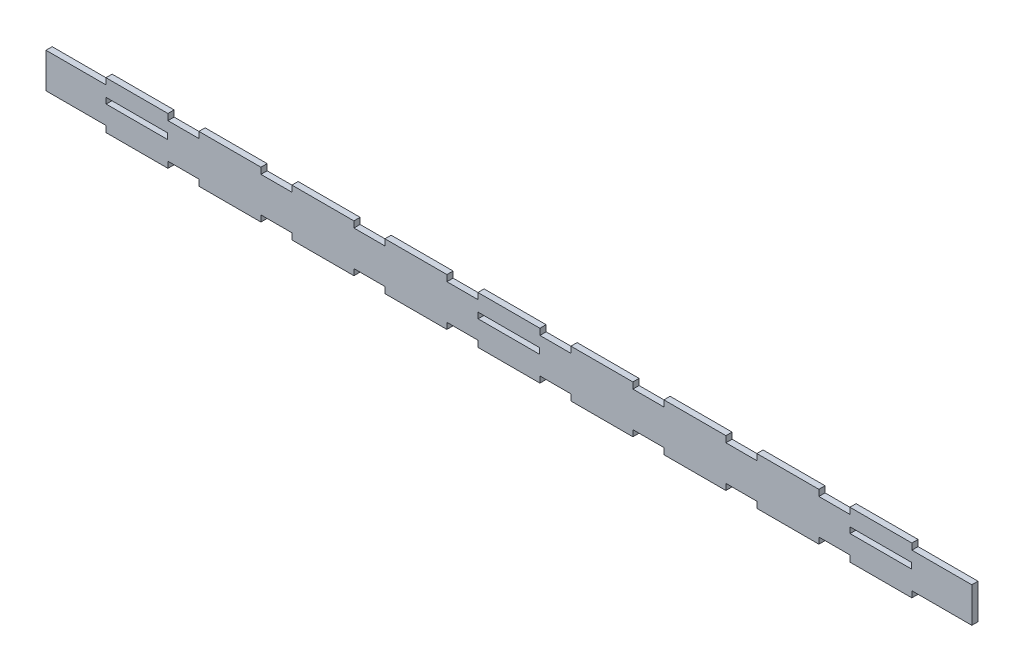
ISO-10303-21;
HEADER;
FILE_DESCRIPTION(('STEP AP214'),'2;1');
FILE_NAME('part.step','',(''),(''),'','','');
FILE_SCHEMA(('AUTOMOTIVE_DESIGN { 1 0 10303 214 1 1 1 1 }'));
ENDSEC;
DATA;
#1=APPLICATION_CONTEXT('core data for automotive mechanical design processes');
#2=APPLICATION_PROTOCOL_DEFINITION('international standard','automotive_design',2000,#1);
#3=PRODUCT_CONTEXT('',#1,'mechanical');
#4=PRODUCT('Part','Part','',(#3));
#5=PRODUCT_RELATED_PRODUCT_CATEGORY('part','',(#4));
#6=PRODUCT_DEFINITION_FORMATION('','',#4);
#7=PRODUCT_DEFINITION_CONTEXT('part definition',#1,'design');
#8=PRODUCT_DEFINITION('design','',#6,#7);
#9=PRODUCT_DEFINITION_SHAPE('','',#8);
#10=(LENGTH_UNIT() NAMED_UNIT(*) SI_UNIT(.MILLI.,.METRE.));
#11=(NAMED_UNIT(*) PLANE_ANGLE_UNIT() SI_UNIT($,.RADIAN.));
#12=(NAMED_UNIT(*) SI_UNIT($,.STERADIAN.) SOLID_ANGLE_UNIT());
#13=UNCERTAINTY_MEASURE_WITH_UNIT(LENGTH_MEASURE(1.E-05),#10,'distance_accuracy_value','');
#14=(GEOMETRIC_REPRESENTATION_CONTEXT(3) GLOBAL_UNCERTAINTY_ASSIGNED_CONTEXT((#13)) GLOBAL_UNIT_ASSIGNED_CONTEXT((#10,
#11,#12)) REPRESENTATION_CONTEXT('',''));
#15=CARTESIAN_POINT('',(0.,0.,0.));
#16=DIRECTION('',(0.,0.,1.));
#17=DIRECTION('',(1.,0.,0.));
#18=AXIS2_PLACEMENT_3D('',#15,#16,#17);
#19=CARTESIAN_POINT('',(-224.,-8.5,3.));
#20=DIRECTION('',(0.,1.,0.));
#21=DIRECTION('',(0.,0.,1.));
#22=AXIS2_PLACEMENT_3D('',#19,#20,#21);
#23=PLANE('',#22);
#24=DIRECTION('',(0.,0.,1.));
#25=VECTOR('',#24,1.);
#26=CARTESIAN_POINT('',(-165.,-8.5,0.));
#27=LINE('',#26,#25);
#28=CARTESIAN_POINT('',(-165.,-8.5,0.));
#29=VERTEX_POINT('',#28);
#30=CARTESIAN_POINT('',(-165.,-8.5,3.));
#31=VERTEX_POINT('',#30);
#32=EDGE_CURVE('E678',#29,#31,#27,.T.);
#33=ORIENTED_EDGE('',*,*,#32,.F.);
#34=DIRECTION('',(1.,0.,0.));
#35=VECTOR('',#34,1.);
#36=CARTESIAN_POINT('',(-224.,-8.5,0.));
#37=LINE('',#36,#35);
#38=CARTESIAN_POINT('',(-150.,-8.5,0.));
#39=VERTEX_POINT('',#38);
#40=EDGE_CURVE('E1195',#29,#39,#37,.T.);
#41=ORIENTED_EDGE('',*,*,#40,.T.);
#42=DIRECTION('',(0.,0.,-1.));
#43=VECTOR('',#42,1.);
#44=CARTESIAN_POINT('',(-150.,-8.5,0.));
#45=LINE('',#44,#43);
#46=CARTESIAN_POINT('',(-150.,-8.5,3.));
#47=VERTEX_POINT('',#46);
#48=EDGE_CURVE('E791',#47,#39,#45,.T.);
#49=ORIENTED_EDGE('',*,*,#48,.F.);
#50=DIRECTION('',(1.,0.,0.));
#51=VECTOR('',#50,1.);
#52=CARTESIAN_POINT('',(-224.,-8.5,3.));
#53=LINE('',#52,#51);
#54=EDGE_CURVE('E1182',#31,#47,#53,.T.);
#55=ORIENTED_EDGE('',*,*,#54,.F.);
#56=EDGE_LOOP('',(#33,#41,#49,#55));
#57=FACE_BOUND('',#56,.T.);
#58=ADVANCED_FACE('F32',(#57),#23,.F.);
#59=DIRECTION('',(0.,0.,-1.));
#60=VECTOR('',#59,1.);
#61=CARTESIAN_POINT('',(-195.,-8.5,0.));
#62=LINE('',#61,#60);
#63=CARTESIAN_POINT('',(-195.,-8.5,3.));
#64=VERTEX_POINT('',#63);
#65=CARTESIAN_POINT('',(-195.,-8.5,0.));
#66=VERTEX_POINT('',#65);
#67=EDGE_CURVE('E683',#64,#66,#62,.T.);
#68=ORIENTED_EDGE('',*,*,#67,.F.);
#69=CARTESIAN_POINT('',(-224.,-8.5,3.));
#70=VERTEX_POINT('',#69);
#71=EDGE_CURVE('E1178',#70,#64,#53,.T.);
#72=ORIENTED_EDGE('',*,*,#71,.F.);
#73=DIRECTION('',(0.,0.,-1.));
#74=VECTOR('',#73,1.);
#75=CARTESIAN_POINT('',(-224.,-8.5,3.));
#76=LINE('',#75,#74);
#77=CARTESIAN_POINT('',(-224.,-8.5,0.));
#78=VERTEX_POINT('',#77);
#79=EDGE_CURVE('E1199',#70,#78,#76,.T.);
#80=ORIENTED_EDGE('',*,*,#79,.T.);
#81=EDGE_CURVE('E1169',#78,#66,#37,.T.);
#82=ORIENTED_EDGE('',*,*,#81,.T.);
#83=EDGE_LOOP('',(#68,#72,#80,#82));
#84=FACE_BOUND('',#83,.T.);
#85=ADVANCED_FACE('F1218',(#84),#23,.F.);
#86=DIRECTION('',(0.,0.,1.));
#87=VECTOR('',#86,1.);
#88=CARTESIAN_POINT('',(195.,-8.5,0.));
#89=LINE('',#88,#87);
#90=CARTESIAN_POINT('',(195.,-8.5,0.));
#91=VERTEX_POINT('',#90);
#92=CARTESIAN_POINT('',(195.,-8.5,3.));
#93=VERTEX_POINT('',#92);
#94=EDGE_CURVE('E705',#91,#93,#89,.T.);
#95=ORIENTED_EDGE('',*,*,#94,.F.);
#96=CARTESIAN_POINT('',(224.,-8.5,0.));
#97=VERTEX_POINT('',#96);
#98=EDGE_CURVE('E1193',#91,#97,#37,.T.);
#99=ORIENTED_EDGE('',*,*,#98,.T.);
#100=DIRECTION('',(0.,0.,-1.));
#101=VECTOR('',#100,1.);
#102=CARTESIAN_POINT('',(224.,-8.5,3.));
#103=LINE('',#102,#101);
#104=CARTESIAN_POINT('',(224.,-8.5,3.));
#105=VERTEX_POINT('',#104);
#106=EDGE_CURVE('E1181',#105,#97,#103,.T.);
#107=ORIENTED_EDGE('',*,*,#106,.F.);
#108=EDGE_CURVE('E1177',#93,#105,#53,.T.);
#109=ORIENTED_EDGE('',*,*,#108,.F.);
#110=EDGE_LOOP('',(#95,#99,#107,#109));
#111=FACE_BOUND('',#110,.T.);
#112=ADVANCED_FACE('F1345',(#111),#23,.F.);
#113=DIRECTION('',(0.,0.,-1.));
#114=VECTOR('',#113,1.);
#115=CARTESIAN_POINT('',(165.,-8.5,0.));
#116=LINE('',#115,#114);
#117=CARTESIAN_POINT('',(165.,-8.5,3.));
#118=VERTEX_POINT('',#117);
#119=CARTESIAN_POINT('',(165.,-8.5,0.));
#120=VERTEX_POINT('',#119);
#121=EDGE_CURVE('E710',#118,#120,#116,.T.);
#122=ORIENTED_EDGE('',*,*,#121,.F.);
#123=CARTESIAN_POINT('',(150.,-8.5,3.));
#124=VERTEX_POINT('',#123);
#125=EDGE_CURVE('E1361',#124,#118,#53,.T.);
#126=ORIENTED_EDGE('',*,*,#125,.F.);
#127=DIRECTION('',(0.,0.,1.));
#128=VECTOR('',#127,1.);
#129=CARTESIAN_POINT('',(150.,-8.5,0.));
#130=LINE('',#129,#128);
#131=CARTESIAN_POINT('',(150.,-8.5,0.));
#132=VERTEX_POINT('',#131);
#133=EDGE_CURVE('E818',#132,#124,#130,.T.);
#134=ORIENTED_EDGE('',*,*,#133,.F.);
#135=EDGE_CURVE('E1343',#132,#120,#37,.T.);
#136=ORIENTED_EDGE('',*,*,#135,.T.);
#137=EDGE_LOOP('',(#122,#126,#134,#136));
#138=FACE_BOUND('',#137,.T.);
#139=ADVANCED_FACE('F1360',(#138),#23,.F.);
#140=DIRECTION('',(0.,0.,1.));
#141=VECTOR('',#140,1.);
#142=CARTESIAN_POINT('',(-30.,-8.5,0.));
#143=LINE('',#142,#141);
#144=CARTESIAN_POINT('',(-30.,-8.5,0.));
#145=VERTEX_POINT('',#144);
#146=CARTESIAN_POINT('',(-30.,-8.5,3.));
#147=VERTEX_POINT('',#146);
#148=EDGE_CURVE('E732',#145,#147,#143,.T.);
#149=ORIENTED_EDGE('',*,*,#148,.F.);
#150=CARTESIAN_POINT('',(-15.,-8.5,0.));
#151=VERTEX_POINT('',#150);
#152=EDGE_CURVE('E1344',#145,#151,#37,.T.);
#153=ORIENTED_EDGE('',*,*,#152,.T.);
#154=DIRECTION('',(0.,0.,-1.));
#155=VECTOR('',#154,1.);
#156=CARTESIAN_POINT('',(-15.,-8.5,0.));
#157=LINE('',#156,#155);
#158=CARTESIAN_POINT('',(-15.,-8.5,3.));
#159=VERTEX_POINT('',#158);
#160=EDGE_CURVE('E899',#159,#151,#157,.T.);
#161=ORIENTED_EDGE('',*,*,#160,.F.);
#162=EDGE_CURVE('E1368',#147,#159,#53,.T.);
#163=ORIENTED_EDGE('',*,*,#162,.F.);
#164=EDGE_LOOP('',(#149,#153,#161,#163));
#165=FACE_BOUND('',#164,.T.);
#166=ADVANCED_FACE('F1492',(#165),#23,.F.);
#167=DIRECTION('',(0.,0.,-1.));
#168=VECTOR('',#167,1.);
#169=CARTESIAN_POINT('',(-60.,-8.5,0.));
#170=LINE('',#169,#168);
#171=CARTESIAN_POINT('',(-60.,-8.5,3.));
#172=VERTEX_POINT('',#171);
#173=CARTESIAN_POINT('',(-60.,-8.5,0.));
#174=VERTEX_POINT('',#173);
#175=EDGE_CURVE('E737',#172,#174,#170,.T.);
#176=ORIENTED_EDGE('',*,*,#175,.F.);
#177=CARTESIAN_POINT('',(-75.,-8.5,3.));
#178=VERTEX_POINT('',#177);
#179=EDGE_CURVE('E1370',#178,#172,#53,.T.);
#180=ORIENTED_EDGE('',*,*,#179,.F.);
#181=DIRECTION('',(0.,0.,1.));
#182=VECTOR('',#181,1.);
#183=CARTESIAN_POINT('',(-75.,-8.5,0.));
#184=LINE('',#183,#182);
#185=CARTESIAN_POINT('',(-75.,-8.5,0.));
#186=VERTEX_POINT('',#185);
#187=EDGE_CURVE('E759',#186,#178,#184,.T.);
#188=ORIENTED_EDGE('',*,*,#187,.F.);
#189=EDGE_CURVE('E1412',#186,#174,#37,.T.);
#190=ORIENTED_EDGE('',*,*,#189,.T.);
#191=EDGE_LOOP('',(#176,#180,#188,#190));
#192=FACE_BOUND('',#191,.T.);
#193=ADVANCED_FACE('F1479',(#192),#23,.F.);
#194=DIRECTION('',(0.,0.,-1.));
#195=VECTOR('',#194,1.);
#196=CARTESIAN_POINT('',(-105.,-8.5,0.));
#197=LINE('',#196,#195);
#198=CARTESIAN_POINT('',(-105.,-8.5,3.));
#199=VERTEX_POINT('',#198);
#200=CARTESIAN_POINT('',(-105.,-8.5,0.));
#201=VERTEX_POINT('',#200);
#202=EDGE_CURVE('E764',#199,#201,#197,.T.);
#203=ORIENTED_EDGE('',*,*,#202,.F.);
#204=CARTESIAN_POINT('',(-120.,-8.5,3.));
#205=VERTEX_POINT('',#204);
#206=EDGE_CURVE('E1365',#205,#199,#53,.T.);
#207=ORIENTED_EDGE('',*,*,#206,.F.);
#208=DIRECTION('',(0.,0.,1.));
#209=VECTOR('',#208,1.);
#210=CARTESIAN_POINT('',(-120.,-8.5,0.));
#211=LINE('',#210,#209);
#212=CARTESIAN_POINT('',(-120.,-8.5,0.));
#213=VERTEX_POINT('',#212);
#214=EDGE_CURVE('E786',#213,#205,#211,.T.);
#215=ORIENTED_EDGE('',*,*,#214,.F.);
#216=EDGE_CURVE('E1411',#213,#201,#37,.T.);
#217=ORIENTED_EDGE('',*,*,#216,.T.);
#218=EDGE_LOOP('',(#203,#207,#215,#217));
#219=FACE_BOUND('',#218,.T.);
#220=ADVANCED_FACE('F1440',(#219),#23,.F.);
#221=DIRECTION('',(0.,0.,-1.));
#222=VECTOR('',#221,1.);
#223=CARTESIAN_POINT('',(120.,-8.5,0.));
#224=LINE('',#223,#222);
#225=CARTESIAN_POINT('',(120.,-8.5,3.));
#226=VERTEX_POINT('',#225);
#227=CARTESIAN_POINT('',(120.,-8.5,0.));
#228=VERTEX_POINT('',#227);
#229=EDGE_CURVE('E813',#226,#228,#224,.T.);
#230=ORIENTED_EDGE('',*,*,#229,.F.);
#231=CARTESIAN_POINT('',(105.,-8.5,3.));
#232=VERTEX_POINT('',#231);
#233=EDGE_CURVE('E1364',#232,#226,#53,.T.);
#234=ORIENTED_EDGE('',*,*,#233,.F.);
#235=DIRECTION('',(0.,0.,1.));
#236=VECTOR('',#235,1.);
#237=CARTESIAN_POINT('',(105.,-8.5,0.));
#238=LINE('',#237,#236);
#239=CARTESIAN_POINT('',(105.,-8.5,0.));
#240=VERTEX_POINT('',#239);
#241=EDGE_CURVE('E845',#240,#232,#238,.T.);
#242=ORIENTED_EDGE('',*,*,#241,.F.);
#243=EDGE_CURVE('E1400',#240,#228,#37,.T.);
#244=ORIENTED_EDGE('',*,*,#243,.T.);
#245=EDGE_LOOP('',(#230,#234,#242,#244));
#246=FACE_BOUND('',#245,.T.);
#247=ADVANCED_FACE('F1399',(#246),#23,.F.);
#248=DIRECTION('',(0.,0.,-1.));
#249=VECTOR('',#248,1.);
#250=CARTESIAN_POINT('',(75.,-8.5,0.));
#251=LINE('',#250,#249);
#252=CARTESIAN_POINT('',(75.,-8.5,3.));
#253=VERTEX_POINT('',#252);
#254=CARTESIAN_POINT('',(75.,-8.5,0.));
#255=VERTEX_POINT('',#254);
#256=EDGE_CURVE('E840',#253,#255,#251,.T.);
#257=ORIENTED_EDGE('',*,*,#256,.F.);
#258=CARTESIAN_POINT('',(60.,-8.5,3.));
#259=VERTEX_POINT('',#258);
#260=EDGE_CURVE('E1367',#259,#253,#53,.T.);
#261=ORIENTED_EDGE('',*,*,#260,.F.);
#262=DIRECTION('',(0.,0.,1.));
#263=VECTOR('',#262,1.);
#264=CARTESIAN_POINT('',(60.,-8.5,0.));
#265=LINE('',#264,#263);
#266=CARTESIAN_POINT('',(60.,-8.5,0.));
#267=VERTEX_POINT('',#266);
#268=EDGE_CURVE('E872',#267,#259,#265,.T.);
#269=ORIENTED_EDGE('',*,*,#268,.F.);
#270=EDGE_CURVE('E1410',#267,#255,#37,.T.);
#271=ORIENTED_EDGE('',*,*,#270,.T.);
#272=EDGE_LOOP('',(#257,#261,#269,#271));
#273=FACE_BOUND('',#272,.T.);
#274=ADVANCED_FACE('F1433',(#273),#23,.F.);
#275=DIRECTION('',(0.,0.,-1.));
#276=VECTOR('',#275,1.);
#277=CARTESIAN_POINT('',(30.,-8.5,0.));
#278=LINE('',#277,#276);
#279=CARTESIAN_POINT('',(30.,-8.5,3.));
#280=VERTEX_POINT('',#279);
#281=CARTESIAN_POINT('',(30.,-8.5,0.));
#282=VERTEX_POINT('',#281);
#283=EDGE_CURVE('E867',#280,#282,#278,.T.);
#284=ORIENTED_EDGE('',*,*,#283,.F.);
#285=CARTESIAN_POINT('',(15.,-8.5,3.));
#286=VERTEX_POINT('',#285);
#287=EDGE_CURVE('E1183',#286,#280,#53,.T.);
#288=ORIENTED_EDGE('',*,*,#287,.F.);
#289=DIRECTION('',(0.,0.,1.));
#290=VECTOR('',#289,1.);
#291=CARTESIAN_POINT('',(15.,-8.5,0.));
#292=LINE('',#291,#290);
#293=CARTESIAN_POINT('',(15.,-8.5,0.));
#294=VERTEX_POINT('',#293);
#295=EDGE_CURVE('E894',#294,#286,#292,.T.);
#296=ORIENTED_EDGE('',*,*,#295,.F.);
#297=EDGE_CURVE('E1196',#294,#282,#37,.T.);
#298=ORIENTED_EDGE('',*,*,#297,.T.);
#299=EDGE_LOOP('',(#284,#288,#296,#298));
#300=FACE_BOUND('',#299,.T.);
#301=ADVANCED_FACE('F1421',(#300),#23,.F.);
#302=CARTESIAN_POINT('',(-224.,8.5,3.));
#303=DIRECTION('',(0.,-1.,0.));
#304=DIRECTION('',(0.,0.,-1.));
#305=AXIS2_PLACEMENT_3D('',#302,#303,#304);
#306=PLANE('',#305);
#307=DIRECTION('',(0.,0.,-1.));
#308=VECTOR('',#307,1.);
#309=CARTESIAN_POINT('',(195.,8.5,3.));
#310=LINE('',#309,#308);
#311=CARTESIAN_POINT('',(195.,8.5,3.));
#312=VERTEX_POINT('',#311);
#313=CARTESIAN_POINT('',(195.,8.5,0.));
#314=VERTEX_POINT('',#313);
#315=EDGE_CURVE('E921',#312,#314,#310,.T.);
#316=ORIENTED_EDGE('',*,*,#315,.F.);
#317=DIRECTION('',(-1.,0.,0.));
#318=VECTOR('',#317,1.);
#319=CARTESIAN_POINT('',(-224.,8.5,3.));
#320=LINE('',#319,#318);
#321=CARTESIAN_POINT('',(224.,8.5,3.));
#322=VERTEX_POINT('',#321);
#323=EDGE_CURVE('E1170',#322,#312,#320,.T.);
#324=ORIENTED_EDGE('',*,*,#323,.F.);
#325=DIRECTION('',(0.,0.,-1.));
#326=VECTOR('',#325,1.);
#327=CARTESIAN_POINT('',(224.,8.5,3.));
#328=LINE('',#327,#326);
#329=CARTESIAN_POINT('',(224.,8.5,0.));
#330=VERTEX_POINT('',#329);
#331=EDGE_CURVE('E11',#322,#330,#328,.T.);
#332=ORIENTED_EDGE('',*,*,#331,.T.);
#333=DIRECTION('',(-1.,0.,0.));
#334=VECTOR('',#333,1.);
#335=CARTESIAN_POINT('',(-224.,8.5,0.));
#336=LINE('',#335,#334);
#337=EDGE_CURVE('E1187',#330,#314,#336,.T.);
#338=ORIENTED_EDGE('',*,*,#337,.T.);
#339=EDGE_LOOP('',(#316,#324,#332,#338));
#340=FACE_BOUND('',#339,.T.);
#341=ADVANCED_FACE('F1333',(#340),#306,.F.);
#342=DIRECTION('',(0.,0.,1.));
#343=VECTOR('',#342,1.);
#344=CARTESIAN_POINT('',(165.,8.5,2.99999999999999));
#345=LINE('',#344,#343);
#346=CARTESIAN_POINT('',(165.,8.5,0.));
#347=VERTEX_POINT('',#346);
#348=CARTESIAN_POINT('',(165.,8.5,3.));
#349=VERTEX_POINT('',#348);
#350=EDGE_CURVE('E926',#347,#349,#345,.T.);
#351=ORIENTED_EDGE('',*,*,#350,.F.);
#352=CARTESIAN_POINT('',(150.,8.5,0.));
#353=VERTEX_POINT('',#352);
#354=EDGE_CURVE('E1190',#347,#353,#336,.T.);
#355=ORIENTED_EDGE('',*,*,#354,.T.);
#356=DIRECTION('',(0.,0.,-1.));
#357=VECTOR('',#356,1.);
#358=CARTESIAN_POINT('',(150.,8.5,0.));
#359=LINE('',#358,#357);
#360=CARTESIAN_POINT('',(150.,8.5,3.));
#361=VERTEX_POINT('',#360);
#362=EDGE_CURVE('E1034',#361,#353,#359,.T.);
#363=ORIENTED_EDGE('',*,*,#362,.F.);
#364=EDGE_CURVE('E1174',#349,#361,#320,.T.);
#365=ORIENTED_EDGE('',*,*,#364,.F.);
#366=EDGE_LOOP('',(#351,#355,#363,#365));
#367=FACE_BOUND('',#366,.T.);
#368=ADVANCED_FACE('F1319',(#367),#306,.F.);
#369=DIRECTION('',(0.,0.,-1.));
#370=VECTOR('',#369,1.);
#371=CARTESIAN_POINT('',(-165.,8.5,2.99999999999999));
#372=LINE('',#371,#370);
#373=CARTESIAN_POINT('',(-165.,8.5,3.));
#374=VERTEX_POINT('',#373);
#375=CARTESIAN_POINT('',(-165.,8.5,0.));
#376=VERTEX_POINT('',#375);
#377=EDGE_CURVE('E948',#374,#376,#372,.T.);
#378=ORIENTED_EDGE('',*,*,#377,.F.);
#379=CARTESIAN_POINT('',(-150.,8.5,3.));
#380=VERTEX_POINT('',#379);
#381=EDGE_CURVE('E1228',#380,#374,#320,.T.);
#382=ORIENTED_EDGE('',*,*,#381,.F.);
#383=DIRECTION('',(0.,0.,1.));
#384=VECTOR('',#383,1.);
#385=CARTESIAN_POINT('',(-150.,8.5,0.));
#386=LINE('',#385,#384);
#387=CARTESIAN_POINT('',(-150.,8.5,0.));
#388=VERTEX_POINT('',#387);
#389=EDGE_CURVE('E1061',#388,#380,#386,.T.);
#390=ORIENTED_EDGE('',*,*,#389,.F.);
#391=EDGE_CURVE('E1284',#388,#376,#336,.T.);
#392=ORIENTED_EDGE('',*,*,#391,.T.);
#393=EDGE_LOOP('',(#378,#382,#390,#392));
#394=FACE_BOUND('',#393,.T.);
#395=ADVANCED_FACE('F2007',(#394),#306,.F.);
#396=DIRECTION('',(0.,0.,1.));
#397=VECTOR('',#396,1.);
#398=CARTESIAN_POINT('',(-195.,8.5,3.));
#399=LINE('',#398,#397);
#400=CARTESIAN_POINT('',(-195.,8.5,0.));
#401=VERTEX_POINT('',#400);
#402=CARTESIAN_POINT('',(-195.,8.5,3.));
#403=VERTEX_POINT('',#402);
#404=EDGE_CURVE('E953',#401,#403,#399,.T.);
#405=ORIENTED_EDGE('',*,*,#404,.F.);
#406=CARTESIAN_POINT('',(-224.,8.5,0.));
#407=VERTEX_POINT('',#406);
#408=EDGE_CURVE('E1186',#401,#407,#336,.T.);
#409=ORIENTED_EDGE('',*,*,#408,.T.);
#410=DIRECTION('',(0.,0.,-1.));
#411=VECTOR('',#410,1.);
#412=CARTESIAN_POINT('',(-224.,8.5,3.));
#413=LINE('',#412,#411);
#414=CARTESIAN_POINT('',(-224.,8.5,3.));
#415=VERTEX_POINT('',#414);
#416=EDGE_CURVE('E40',#415,#407,#413,.T.);
#417=ORIENTED_EDGE('',*,*,#416,.F.);
#418=EDGE_CURVE('E1168',#403,#415,#320,.T.);
#419=ORIENTED_EDGE('',*,*,#418,.F.);
#420=EDGE_LOOP('',(#405,#409,#417,#419));
#421=FACE_BOUND('',#420,.T.);
#422=ADVANCED_FACE('F2001',(#421),#306,.F.);
#423=DIRECTION('',(0.,0.,1.));
#424=VECTOR('',#423,1.);
#425=CARTESIAN_POINT('',(30.,8.5,0.));
#426=LINE('',#425,#424);
#427=CARTESIAN_POINT('',(30.,8.5,0.));
#428=VERTEX_POINT('',#427);
#429=CARTESIAN_POINT('',(30.,8.5,3.));
#430=VERTEX_POINT('',#429);
#431=EDGE_CURVE('E975',#428,#430,#426,.T.);
#432=ORIENTED_EDGE('',*,*,#431,.F.);
#433=CARTESIAN_POINT('',(15.,8.5,0.));
#434=VERTEX_POINT('',#433);
#435=EDGE_CURVE('E1261',#428,#434,#336,.T.);
#436=ORIENTED_EDGE('',*,*,#435,.T.);
#437=DIRECTION('',(0.,0.,-1.));
#438=VECTOR('',#437,1.);
#439=CARTESIAN_POINT('',(15.,8.5,0.));
#440=LINE('',#439,#438);
#441=CARTESIAN_POINT('',(15.,8.5,3.));
#442=VERTEX_POINT('',#441);
#443=EDGE_CURVE('E1142',#442,#434,#440,.T.);
#444=ORIENTED_EDGE('',*,*,#443,.F.);
#445=EDGE_CURVE('E1229',#430,#442,#320,.T.);
#446=ORIENTED_EDGE('',*,*,#445,.F.);
#447=EDGE_LOOP('',(#432,#436,#444,#446));
#448=FACE_BOUND('',#447,.T.);
#449=ADVANCED_FACE('F1260',(#448),#306,.F.);
#450=DIRECTION('',(0.,0.,-1.));
#451=VECTOR('',#450,1.);
#452=CARTESIAN_POINT('',(60.,8.5,0.));
#453=LINE('',#452,#451);
#454=CARTESIAN_POINT('',(60.,8.5,3.));
#455=VERTEX_POINT('',#454);
#456=CARTESIAN_POINT('',(60.,8.5,0.));
#457=VERTEX_POINT('',#456);
#458=EDGE_CURVE('E980',#455,#457,#453,.T.);
#459=ORIENTED_EDGE('',*,*,#458,.F.);
#460=CARTESIAN_POINT('',(75.,8.5,3.));
#461=VERTEX_POINT('',#460);
#462=EDGE_CURVE('E1233',#461,#455,#320,.T.);
#463=ORIENTED_EDGE('',*,*,#462,.F.);
#464=DIRECTION('',(0.,0.,1.));
#465=VECTOR('',#464,1.);
#466=CARTESIAN_POINT('',(75.,8.5,0.));
#467=LINE('',#466,#465);
#468=CARTESIAN_POINT('',(75.,8.5,0.));
#469=VERTEX_POINT('',#468);
#470=EDGE_CURVE('E1002',#469,#461,#467,.T.);
#471=ORIENTED_EDGE('',*,*,#470,.F.);
#472=EDGE_CURVE('E1280',#469,#457,#336,.T.);
#473=ORIENTED_EDGE('',*,*,#472,.T.);
#474=EDGE_LOOP('',(#459,#463,#471,#473));
#475=FACE_BOUND('',#474,.T.);
#476=ADVANCED_FACE('F1292',(#475),#306,.F.);
#477=DIRECTION('',(0.,0.,-1.));
#478=VECTOR('',#477,1.);
#479=CARTESIAN_POINT('',(105.,8.5,0.));
#480=LINE('',#479,#478);
#481=CARTESIAN_POINT('',(105.,8.5,3.));
#482=VERTEX_POINT('',#481);
#483=CARTESIAN_POINT('',(105.,8.5,0.));
#484=VERTEX_POINT('',#483);
#485=EDGE_CURVE('E1007',#482,#484,#480,.T.);
#486=ORIENTED_EDGE('',*,*,#485,.F.);
#487=CARTESIAN_POINT('',(120.,8.5,3.));
#488=VERTEX_POINT('',#487);
#489=EDGE_CURVE('E1232',#488,#482,#320,.T.);
#490=ORIENTED_EDGE('',*,*,#489,.F.);
#491=DIRECTION('',(0.,0.,1.));
#492=VECTOR('',#491,1.);
#493=CARTESIAN_POINT('',(120.,8.5,0.));
#494=LINE('',#493,#492);
#495=CARTESIAN_POINT('',(120.,8.5,0.));
#496=VERTEX_POINT('',#495);
#497=EDGE_CURVE('E1029',#496,#488,#494,.T.);
#498=ORIENTED_EDGE('',*,*,#497,.F.);
#499=EDGE_CURVE('E1287',#496,#484,#336,.T.);
#500=ORIENTED_EDGE('',*,*,#499,.T.);
#501=EDGE_LOOP('',(#486,#490,#498,#500));
#502=FACE_BOUND('',#501,.T.);
#503=ADVANCED_FACE('F1305',(#502),#306,.F.);
#504=DIRECTION('',(0.,0.,-1.));
#505=VECTOR('',#504,1.);
#506=CARTESIAN_POINT('',(-120.,8.5,0.));
#507=LINE('',#506,#505);
#508=CARTESIAN_POINT('',(-120.,8.5,3.));
#509=VERTEX_POINT('',#508);
#510=CARTESIAN_POINT('',(-120.,8.5,0.));
#511=VERTEX_POINT('',#510);
#512=EDGE_CURVE('E1056',#509,#511,#507,.T.);
#513=ORIENTED_EDGE('',*,*,#512,.F.);
#514=CARTESIAN_POINT('',(-105.,8.5,3.));
#515=VERTEX_POINT('',#514);
#516=EDGE_CURVE('E1231',#515,#509,#320,.T.);
#517=ORIENTED_EDGE('',*,*,#516,.F.);
#518=DIRECTION('',(0.,0.,1.));
#519=VECTOR('',#518,1.);
#520=CARTESIAN_POINT('',(-105.,8.5,0.));
#521=LINE('',#520,#519);
#522=CARTESIAN_POINT('',(-105.,8.5,0.));
#523=VERTEX_POINT('',#522);
#524=EDGE_CURVE('E1088',#523,#515,#521,.T.);
#525=ORIENTED_EDGE('',*,*,#524,.F.);
#526=EDGE_CURVE('E1281',#523,#511,#336,.T.);
#527=ORIENTED_EDGE('',*,*,#526,.T.);
#528=EDGE_LOOP('',(#513,#517,#525,#527));
#529=FACE_BOUND('',#528,.T.);
#530=ADVANCED_FACE('F1980',(#529),#306,.F.);
#531=DIRECTION('',(0.,0.,-1.));
#532=VECTOR('',#531,1.);
#533=CARTESIAN_POINT('',(-75.,8.5,0.));
#534=LINE('',#533,#532);
#535=CARTESIAN_POINT('',(-75.,8.5,3.));
#536=VERTEX_POINT('',#535);
#537=CARTESIAN_POINT('',(-75.,8.5,0.));
#538=VERTEX_POINT('',#537);
#539=EDGE_CURVE('E1083',#536,#538,#534,.T.);
#540=ORIENTED_EDGE('',*,*,#539,.F.);
#541=CARTESIAN_POINT('',(-60.,8.5,3.));
#542=VERTEX_POINT('',#541);
#543=EDGE_CURVE('E2385',#542,#536,#320,.T.);
#544=ORIENTED_EDGE('',*,*,#543,.F.);
#545=DIRECTION('',(0.,0.,1.));
#546=VECTOR('',#545,1.);
#547=CARTESIAN_POINT('',(-60.,8.5,0.));
#548=LINE('',#547,#546);
#549=CARTESIAN_POINT('',(-60.,8.5,0.));
#550=VERTEX_POINT('',#549);
#551=EDGE_CURVE('E1115',#550,#542,#548,.T.);
#552=ORIENTED_EDGE('',*,*,#551,.F.);
#553=EDGE_CURVE('E1279',#550,#538,#336,.T.);
#554=ORIENTED_EDGE('',*,*,#553,.T.);
#555=EDGE_LOOP('',(#540,#544,#552,#554));
#556=FACE_BOUND('',#555,.T.);
#557=ADVANCED_FACE('F1973',(#556),#306,.F.);
#558=DIRECTION('',(0.,0.,-1.));
#559=VECTOR('',#558,1.);
#560=CARTESIAN_POINT('',(-30.,8.5,0.));
#561=LINE('',#560,#559);
#562=CARTESIAN_POINT('',(-30.,8.5,3.));
#563=VERTEX_POINT('',#562);
#564=CARTESIAN_POINT('',(-30.,8.5,0.));
#565=VERTEX_POINT('',#564);
#566=EDGE_CURVE('E1110',#563,#565,#561,.T.);
#567=ORIENTED_EDGE('',*,*,#566,.F.);
#568=CARTESIAN_POINT('',(-15.,8.5,3.));
#569=VERTEX_POINT('',#568);
#570=EDGE_CURVE('E1175',#569,#563,#320,.T.);
#571=ORIENTED_EDGE('',*,*,#570,.F.);
#572=DIRECTION('',(0.,0.,1.));
#573=VECTOR('',#572,1.);
#574=CARTESIAN_POINT('',(-15.,8.5,0.));
#575=LINE('',#574,#573);
#576=CARTESIAN_POINT('',(-15.,8.5,0.));
#577=VERTEX_POINT('',#576);
#578=EDGE_CURVE('E1137',#577,#569,#575,.T.);
#579=ORIENTED_EDGE('',*,*,#578,.F.);
#580=EDGE_CURVE('E1191',#577,#565,#336,.T.);
#581=ORIENTED_EDGE('',*,*,#580,.T.);
#582=EDGE_LOOP('',(#567,#571,#579,#581));
#583=FACE_BOUND('',#582,.T.);
#584=ADVANCED_FACE('F1277',(#583),#306,.F.);
#585=CARTESIAN_POINT('',(224.,-8.5,3.));
#586=DIRECTION('',(-1.,0.,0.));
#587=DIRECTION('',(0.,0.,1.));
#588=AXIS2_PLACEMENT_3D('',#585,#586,#587);
#589=PLANE('',#588);
#590=DIRECTION('',(0.,1.,0.));
#591=VECTOR('',#590,1.);
#592=CARTESIAN_POINT('',(224.,-8.5,0.));
#593=LINE('',#592,#591);
#594=EDGE_CURVE('E1164',#97,#330,#593,.T.);
#595=ORIENTED_EDGE('',*,*,#594,.T.);
#596=ORIENTED_EDGE('',*,*,#331,.F.);
#597=DIRECTION('',(0.,1.,0.));
#598=VECTOR('',#597,1.);
#599=CARTESIAN_POINT('',(224.,-8.5,3.));
#600=LINE('',#599,#598);
#601=EDGE_CURVE('E1165',#105,#322,#600,.T.);
#602=ORIENTED_EDGE('',*,*,#601,.F.);
#603=ORIENTED_EDGE('',*,*,#106,.T.);
#604=EDGE_LOOP('',(#595,#596,#602,#603));
#605=FACE_BOUND('',#604,.T.);
#606=ADVANCED_FACE('F34',(#605),#589,.F.);
#607=CARTESIAN_POINT('',(-224.,-8.5,3.));
#608=DIRECTION('',(1.,0.,0.));
#609=DIRECTION('',(0.,0.,-1.));
#610=AXIS2_PLACEMENT_3D('',#607,#608,#609);
#611=PLANE('',#610);
#612=DIRECTION('',(0.,-1.,0.));
#613=VECTOR('',#612,1.);
#614=CARTESIAN_POINT('',(-224.,-8.5,0.));
#615=LINE('',#614,#613);
#616=EDGE_CURVE('E1189',#407,#78,#615,.T.);
#617=ORIENTED_EDGE('',*,*,#616,.T.);
#618=ORIENTED_EDGE('',*,*,#79,.F.);
#619=DIRECTION('',(0.,-1.,0.));
#620=VECTOR('',#619,1.);
#621=CARTESIAN_POINT('',(-224.,-8.5,3.));
#622=LINE('',#621,#620);
#623=EDGE_CURVE('E1173',#415,#70,#622,.T.);
#624=ORIENTED_EDGE('',*,*,#623,.F.);
#625=ORIENTED_EDGE('',*,*,#416,.T.);
#626=EDGE_LOOP('',(#617,#618,#624,#625));
#627=FACE_BOUND('',#626,.T.);
#628=ADVANCED_FACE('F1206',(#627),#611,.F.);
#629=CARTESIAN_POINT('',(0.,0.,3.));
#630=DIRECTION('',(0.,0.,-1.));
#631=DIRECTION('',(-1.,0.,0.));
#632=AXIS2_PLACEMENT_3D('',#629,#630,#631);
#633=PLANE('',#632);
#634=DIRECTION('',(1.,0.,0.));
#635=VECTOR('',#634,1.);
#636=CARTESIAN_POINT('',(14.9,0.499999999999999,3.));
#637=LINE('',#636,#635);
#638=CARTESIAN_POINT('',(-14.9,0.499999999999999,3.));
#639=VERTEX_POINT('',#638);
#640=CARTESIAN_POINT('',(14.9,0.499999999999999,3.));
#641=VERTEX_POINT('',#640);
#642=EDGE_CURVE('E601',#639,#641,#637,.T.);
#643=ORIENTED_EDGE('',*,*,#642,.F.);
#644=DIRECTION('',(0.,-1.,0.));
#645=VECTOR('',#644,1.);
#646=CARTESIAN_POINT('',(-14.9,0.499999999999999,3.));
#647=LINE('',#646,#645);
#648=CARTESIAN_POINT('',(-14.9,3.3,3.));
#649=VERTEX_POINT('',#648);
#650=EDGE_CURVE('E581',#649,#639,#647,.T.);
#651=ORIENTED_EDGE('',*,*,#650,.F.);
#652=DIRECTION('',(-1.,0.,0.));
#653=VECTOR('',#652,1.);
#654=CARTESIAN_POINT('',(14.9,3.3,3.));
#655=LINE('',#654,#653);
#656=CARTESIAN_POINT('',(14.9,3.3,3.));
#657=VERTEX_POINT('',#656);
#658=EDGE_CURVE('E592',#657,#649,#655,.T.);
#659=ORIENTED_EDGE('',*,*,#658,.F.);
#660=DIRECTION('',(0.,1.,0.));
#661=VECTOR('',#660,1.);
#662=CARTESIAN_POINT('',(14.9,0.499999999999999,3.));
#663=LINE('',#662,#661);
#664=EDGE_CURVE('E47',#641,#657,#663,.T.);
#665=ORIENTED_EDGE('',*,*,#664,.F.);
#666=EDGE_LOOP('',(#643,#651,#659,#665));
#667=FACE_BOUND('',#666,.T.);
#668=DIRECTION('',(1.,0.,0.));
#669=VECTOR('',#668,1.);
#670=CARTESIAN_POINT('',(-165.1,0.499999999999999,3.));
#671=LINE('',#670,#669);
#672=CARTESIAN_POINT('',(-194.9,0.499999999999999,3.));
#673=VERTEX_POINT('',#672);
#674=CARTESIAN_POINT('',(-165.1,0.499999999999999,3.));
#675=VERTEX_POINT('',#674);
#676=EDGE_CURVE('E619',#673,#675,#671,.T.);
#677=ORIENTED_EDGE('',*,*,#676,.F.);
#678=DIRECTION('',(0.,-1.,0.));
#679=VECTOR('',#678,1.);
#680=CARTESIAN_POINT('',(-194.9,0.499999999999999,3.));
#681=LINE('',#680,#679);
#682=CARTESIAN_POINT('',(-194.9,3.3,3.));
#683=VERTEX_POINT('',#682);
#684=EDGE_CURVE('E622',#683,#673,#681,.T.);
#685=ORIENTED_EDGE('',*,*,#684,.F.);
#686=DIRECTION('',(-1.,0.,0.));
#687=VECTOR('',#686,1.);
#688=CARTESIAN_POINT('',(-165.1,3.3,3.));
#689=LINE('',#688,#687);
#690=CARTESIAN_POINT('',(-165.1,3.3,3.));
#691=VERTEX_POINT('',#690);
#692=EDGE_CURVE('E639',#691,#683,#689,.T.);
#693=ORIENTED_EDGE('',*,*,#692,.F.);
#694=DIRECTION('',(0.,1.,0.));
#695=VECTOR('',#694,1.);
#696=CARTESIAN_POINT('',(-165.1,0.499999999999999,3.));
#697=LINE('',#696,#695);
#698=EDGE_CURVE('E55',#675,#691,#697,.T.);
#699=ORIENTED_EDGE('',*,*,#698,.F.);
#700=EDGE_LOOP('',(#677,#685,#693,#699));
#701=FACE_BOUND('',#700,.T.);
#702=DIRECTION('',(1.,0.,0.));
#703=VECTOR('',#702,1.);
#704=CARTESIAN_POINT('',(194.9,0.499999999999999,3.));
#705=LINE('',#704,#703);
#706=CARTESIAN_POINT('',(165.1,0.499999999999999,3.));
#707=VERTEX_POINT('',#706);
#708=CARTESIAN_POINT('',(194.9,0.499999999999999,3.));
#709=VERTEX_POINT('',#708);
#710=EDGE_CURVE('E649',#707,#709,#705,.T.);
#711=ORIENTED_EDGE('',*,*,#710,.F.);
#712=DIRECTION('',(0.,-1.,0.));
#713=VECTOR('',#712,1.);
#714=CARTESIAN_POINT('',(165.1,3.3,3.));
#715=LINE('',#714,#713);
#716=CARTESIAN_POINT('',(165.1,3.3,3.));
#717=VERTEX_POINT('',#716);
#718=EDGE_CURVE('E652',#717,#707,#715,.T.);
#719=ORIENTED_EDGE('',*,*,#718,.F.);
#720=DIRECTION('',(-1.,0.,0.));
#721=VECTOR('',#720,1.);
#722=CARTESIAN_POINT('',(194.9,3.3,3.));
#723=LINE('',#722,#721);
#724=CARTESIAN_POINT('',(194.9,3.3,3.));
#725=VERTEX_POINT('',#724);
#726=EDGE_CURVE('E669',#725,#717,#723,.T.);
#727=ORIENTED_EDGE('',*,*,#726,.F.);
#728=DIRECTION('',(0.,1.,0.));
#729=VECTOR('',#728,1.);
#730=CARTESIAN_POINT('',(194.9,3.3,3.));
#731=LINE('',#730,#729);
#732=EDGE_CURVE('E595',#709,#725,#731,.T.);
#733=ORIENTED_EDGE('',*,*,#732,.F.);
#734=EDGE_LOOP('',(#711,#719,#727,#733));
#735=FACE_BOUND('',#734,.T.);
#736=ORIENTED_EDGE('',*,*,#601,.T.);
#737=ORIENTED_EDGE('',*,*,#323,.T.);
#738=DIRECTION('',(0.,-1.,0.));
#739=VECTOR('',#738,1.);
#740=CARTESIAN_POINT('',(195.,11.5,3.));
#741=LINE('',#740,#739);
#742=CARTESIAN_POINT('',(195.,11.5,3.));
#743=VERTEX_POINT('',#742);
#744=EDGE_CURVE('E945',#743,#312,#741,.T.);
#745=ORIENTED_EDGE('',*,*,#744,.F.);
#746=DIRECTION('',(1.,0.,0.));
#747=VECTOR('',#746,1.);
#748=CARTESIAN_POINT('',(165.,11.5,2.99999999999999));
#749=LINE('',#748,#747);
#750=CARTESIAN_POINT('',(165.,11.5,2.99999999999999));
#751=VERTEX_POINT('',#750);
#752=EDGE_CURVE('E922',#751,#743,#749,.T.);
#753=ORIENTED_EDGE('',*,*,#752,.F.);
#754=DIRECTION('',(0.,-1.,0.));
#755=VECTOR('',#754,1.);
#756=CARTESIAN_POINT('',(165.,11.5,2.99999999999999));
#757=LINE('',#756,#755);
#758=EDGE_CURVE('E932',#751,#349,#757,.T.);
#759=ORIENTED_EDGE('',*,*,#758,.T.);
#760=ORIENTED_EDGE('',*,*,#364,.T.);
#761=DIRECTION('',(0.,-1.,0.));
#762=VECTOR('',#761,1.);
#763=CARTESIAN_POINT('',(150.,11.5,2.99999999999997));
#764=LINE('',#763,#762);
#765=CARTESIAN_POINT('',(150.,11.5,2.99999999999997));
#766=VERTEX_POINT('',#765);
#767=EDGE_CURVE('E1047',#766,#361,#764,.T.);
#768=ORIENTED_EDGE('',*,*,#767,.F.);
#769=DIRECTION('',(1.,0.,0.));
#770=VECTOR('',#769,1.);
#771=CARTESIAN_POINT('',(120.,11.5,2.99999999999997));
#772=LINE('',#771,#770);
#773=CARTESIAN_POINT('',(120.,11.5,2.99999999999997));
#774=VERTEX_POINT('',#773);
#775=EDGE_CURVE('E1036',#774,#766,#772,.T.);
#776=ORIENTED_EDGE('',*,*,#775,.F.);
#777=DIRECTION('',(0.,-1.,0.));
#778=VECTOR('',#777,1.);
#779=CARTESIAN_POINT('',(120.,11.5,2.99999999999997));
#780=LINE('',#779,#778);
#781=EDGE_CURVE('E1050',#774,#488,#780,.T.);
#782=ORIENTED_EDGE('',*,*,#781,.T.);
#783=ORIENTED_EDGE('',*,*,#489,.T.);
#784=DIRECTION('',(0.,-1.,0.));
#785=VECTOR('',#784,1.);
#786=CARTESIAN_POINT('',(105.,11.5,2.99999999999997));
#787=LINE('',#786,#785);
#788=CARTESIAN_POINT('',(105.,11.5,2.99999999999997));
#789=VERTEX_POINT('',#788);
#790=EDGE_CURVE('E1020',#789,#482,#787,.T.);
#791=ORIENTED_EDGE('',*,*,#790,.F.);
#792=DIRECTION('',(1.,0.,0.));
#793=VECTOR('',#792,1.);
#794=CARTESIAN_POINT('',(75.,11.5,2.99999999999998));
#795=LINE('',#794,#793);
#796=CARTESIAN_POINT('',(75.,11.5,2.99999999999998));
#797=VERTEX_POINT('',#796);
#798=EDGE_CURVE('E1009',#797,#789,#795,.T.);
#799=ORIENTED_EDGE('',*,*,#798,.F.);
#800=DIRECTION('',(0.,-1.,0.));
#801=VECTOR('',#800,1.);
#802=CARTESIAN_POINT('',(75.,11.5,2.99999999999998));
#803=LINE('',#802,#801);
#804=EDGE_CURVE('E1023',#797,#461,#803,.T.);
#805=ORIENTED_EDGE('',*,*,#804,.T.);
#806=ORIENTED_EDGE('',*,*,#462,.T.);
#807=DIRECTION('',(0.,-1.,0.));
#808=VECTOR('',#807,1.);
#809=CARTESIAN_POINT('',(60.,11.5,2.99999999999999));
#810=LINE('',#809,#808);
#811=CARTESIAN_POINT('',(60.,11.5,2.99999999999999));
#812=VERTEX_POINT('',#811);
#813=EDGE_CURVE('E993',#812,#455,#810,.T.);
#814=ORIENTED_EDGE('',*,*,#813,.F.);
#815=DIRECTION('',(1.,0.,0.));
#816=VECTOR('',#815,1.);
#817=CARTESIAN_POINT('',(30.,11.5,2.99999999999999));
#818=LINE('',#817,#816);
#819=CARTESIAN_POINT('',(30.,11.5,2.99999999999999));
#820=VERTEX_POINT('',#819);
#821=EDGE_CURVE('E982',#820,#812,#818,.T.);
#822=ORIENTED_EDGE('',*,*,#821,.F.);
#823=DIRECTION('',(0.,-1.,0.));
#824=VECTOR('',#823,1.);
#825=CARTESIAN_POINT('',(30.,11.5,2.99999999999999));
#826=LINE('',#825,#824);
#827=EDGE_CURVE('E996',#820,#430,#826,.T.);
#828=ORIENTED_EDGE('',*,*,#827,.T.);
#829=ORIENTED_EDGE('',*,*,#445,.T.);
#830=DIRECTION('',(0.,-1.,0.));
#831=VECTOR('',#830,1.);
#832=CARTESIAN_POINT('',(15.,11.5,3.));
#833=LINE('',#832,#831);
#834=CARTESIAN_POINT('',(15.,11.5,3.));
#835=VERTEX_POINT('',#834);
#836=EDGE_CURVE('E1158',#835,#442,#833,.T.);
#837=ORIENTED_EDGE('',*,*,#836,.F.);
#838=DIRECTION('',(1.,0.,0.));
#839=VECTOR('',#838,1.);
#840=CARTESIAN_POINT('',(-15.,11.5,3.));
#841=LINE('',#840,#839);
#842=CARTESIAN_POINT('',(-15.,11.5,3.));
#843=VERTEX_POINT('',#842);
#844=EDGE_CURVE('E1141',#843,#835,#841,.T.);
#845=ORIENTED_EDGE('',*,*,#844,.F.);
#846=DIRECTION('',(0.,-1.,0.));
#847=VECTOR('',#846,1.);
#848=CARTESIAN_POINT('',(-15.,11.5,3.));
#849=LINE('',#848,#847);
#850=EDGE_CURVE('E1161',#843,#569,#849,.T.);
#851=ORIENTED_EDGE('',*,*,#850,.T.);
#852=ORIENTED_EDGE('',*,*,#570,.T.);
#853=DIRECTION('',(0.,-1.,0.));
#854=VECTOR('',#853,1.);
#855=CARTESIAN_POINT('',(-30.,11.5,3.));
#856=LINE('',#855,#854);
#857=CARTESIAN_POINT('',(-30.,11.5,3.));
#858=VERTEX_POINT('',#857);
#859=EDGE_CURVE('E1121',#858,#563,#856,.T.);
#860=ORIENTED_EDGE('',*,*,#859,.F.);
#861=DIRECTION('',(1.,0.,0.));
#862=VECTOR('',#861,1.);
#863=CARTESIAN_POINT('',(-30.,11.5,3.));
#864=LINE('',#863,#862);
#865=CARTESIAN_POINT('',(-60.,11.5,3.));
#866=VERTEX_POINT('',#865);
#867=EDGE_CURVE('E1119',#866,#858,#864,.T.);
#868=ORIENTED_EDGE('',*,*,#867,.F.);
#869=DIRECTION('',(0.,-1.,0.));
#870=VECTOR('',#869,1.);
#871=CARTESIAN_POINT('',(-60.,11.5,3.));
#872=LINE('',#871,#870);
#873=EDGE_CURVE('E1128',#866,#542,#872,.T.);
#874=ORIENTED_EDGE('',*,*,#873,.T.);
#875=ORIENTED_EDGE('',*,*,#543,.T.);
#876=DIRECTION('',(0.,-1.,0.));
#877=VECTOR('',#876,1.);
#878=CARTESIAN_POINT('',(-75.,11.5,2.99999999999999));
#879=LINE('',#878,#877);
#880=CARTESIAN_POINT('',(-75.,11.5,2.99999999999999));
#881=VERTEX_POINT('',#880);
#882=EDGE_CURVE('E1094',#881,#536,#879,.T.);
#883=ORIENTED_EDGE('',*,*,#882,.F.);
#884=DIRECTION('',(1.,0.,0.));
#885=VECTOR('',#884,1.);
#886=CARTESIAN_POINT('',(-75.,11.5,2.99999999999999));
#887=LINE('',#886,#885);
#888=CARTESIAN_POINT('',(-105.,11.5,3.));
#889=VERTEX_POINT('',#888);
#890=EDGE_CURVE('E1092',#889,#881,#887,.T.);
#891=ORIENTED_EDGE('',*,*,#890,.F.);
#892=DIRECTION('',(0.,-1.,0.));
#893=VECTOR('',#892,1.);
#894=CARTESIAN_POINT('',(-105.,11.5,3.));
#895=LINE('',#894,#893);
#896=EDGE_CURVE('E1101',#889,#515,#895,.T.);
#897=ORIENTED_EDGE('',*,*,#896,.T.);
#898=ORIENTED_EDGE('',*,*,#516,.T.);
#899=DIRECTION('',(0.,-1.,0.));
#900=VECTOR('',#899,1.);
#901=CARTESIAN_POINT('',(-120.,11.5,3.));
#902=LINE('',#901,#900);
#903=CARTESIAN_POINT('',(-120.,11.5,3.));
#904=VERTEX_POINT('',#903);
#905=EDGE_CURVE('E1067',#904,#509,#902,.T.);
#906=ORIENTED_EDGE('',*,*,#905,.F.);
#907=DIRECTION('',(1.,0.,0.));
#908=VECTOR('',#907,1.);
#909=CARTESIAN_POINT('',(-120.,11.5,3.));
#910=LINE('',#909,#908);
#911=CARTESIAN_POINT('',(-150.,11.5,3.));
#912=VERTEX_POINT('',#911);
#913=EDGE_CURVE('E1065',#912,#904,#910,.T.);
#914=ORIENTED_EDGE('',*,*,#913,.F.);
#915=DIRECTION('',(0.,-1.,0.));
#916=VECTOR('',#915,1.);
#917=CARTESIAN_POINT('',(-150.,11.5,3.));
#918=LINE('',#917,#916);
#919=EDGE_CURVE('E1074',#912,#380,#918,.T.);
#920=ORIENTED_EDGE('',*,*,#919,.T.);
#921=ORIENTED_EDGE('',*,*,#381,.T.);
#922=DIRECTION('',(0.,-1.,0.));
#923=VECTOR('',#922,1.);
#924=CARTESIAN_POINT('',(-165.,11.5,2.99999999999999));
#925=LINE('',#924,#923);
#926=CARTESIAN_POINT('',(-165.,11.5,2.99999999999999));
#927=VERTEX_POINT('',#926);
#928=EDGE_CURVE('E959',#927,#374,#925,.T.);
#929=ORIENTED_EDGE('',*,*,#928,.F.);
#930=DIRECTION('',(1.,0.,0.));
#931=VECTOR('',#930,1.);
#932=CARTESIAN_POINT('',(-165.,11.5,2.99999999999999));
#933=LINE('',#932,#931);
#934=CARTESIAN_POINT('',(-195.,11.5,3.));
#935=VERTEX_POINT('',#934);
#936=EDGE_CURVE('E957',#935,#927,#933,.T.);
#937=ORIENTED_EDGE('',*,*,#936,.F.);
#938=DIRECTION('',(0.,-1.,0.));
#939=VECTOR('',#938,1.);
#940=CARTESIAN_POINT('',(-195.,11.5,3.));
#941=LINE('',#940,#939);
#942=EDGE_CURVE('E966',#935,#403,#941,.T.);
#943=ORIENTED_EDGE('',*,*,#942,.T.);
#944=ORIENTED_EDGE('',*,*,#418,.T.);
#945=ORIENTED_EDGE('',*,*,#623,.T.);
#946=ORIENTED_EDGE('',*,*,#71,.T.);
#947=DIRECTION('',(0.,1.,0.));
#948=VECTOR('',#947,1.);
#949=CARTESIAN_POINT('',(-195.,-11.5,3.00000000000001));
#950=LINE('',#949,#948);
#951=CARTESIAN_POINT('',(-195.,-11.5,3.00000000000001));
#952=VERTEX_POINT('',#951);
#953=EDGE_CURVE('E696',#952,#64,#950,.T.);
#954=ORIENTED_EDGE('',*,*,#953,.F.);
#955=DIRECTION('',(-1.,0.,0.));
#956=VECTOR('',#955,1.);
#957=CARTESIAN_POINT('',(-195.,-11.5,3.00000000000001));
#958=LINE('',#957,#956);
#959=CARTESIAN_POINT('',(-165.,-11.5,3.));
#960=VERTEX_POINT('',#959);
#961=EDGE_CURVE('E685',#960,#952,#958,.T.);
#962=ORIENTED_EDGE('',*,*,#961,.F.);
#963=DIRECTION('',(0.,1.,0.));
#964=VECTOR('',#963,1.);
#965=CARTESIAN_POINT('',(-165.,-11.5,3.));
#966=LINE('',#965,#964);
#967=EDGE_CURVE('E699',#960,#31,#966,.T.);
#968=ORIENTED_EDGE('',*,*,#967,.T.);
#969=ORIENTED_EDGE('',*,*,#54,.T.);
#970=DIRECTION('',(0.,1.,0.));
#971=VECTOR('',#970,1.);
#972=CARTESIAN_POINT('',(-150.,-11.5,3.00000000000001));
#973=LINE('',#972,#971);
#974=CARTESIAN_POINT('',(-150.,-11.5,3.00000000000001));
#975=VERTEX_POINT('',#974);
#976=EDGE_CURVE('E804',#975,#47,#973,.T.);
#977=ORIENTED_EDGE('',*,*,#976,.F.);
#978=DIRECTION('',(-1.,0.,0.));
#979=VECTOR('',#978,1.);
#980=CARTESIAN_POINT('',(-120.,-11.5,3.));
#981=LINE('',#980,#979);
#982=CARTESIAN_POINT('',(-120.,-11.5,3.));
#983=VERTEX_POINT('',#982);
#984=EDGE_CURVE('E793',#983,#975,#981,.T.);
#985=ORIENTED_EDGE('',*,*,#984,.F.);
#986=DIRECTION('',(0.,1.,0.));
#987=VECTOR('',#986,1.);
#988=CARTESIAN_POINT('',(-120.,-11.5,3.));
#989=LINE('',#988,#987);
#990=EDGE_CURVE('E807',#983,#205,#989,.T.);
#991=ORIENTED_EDGE('',*,*,#990,.T.);
#992=ORIENTED_EDGE('',*,*,#206,.T.);
#993=DIRECTION('',(0.,1.,0.));
#994=VECTOR('',#993,1.);
#995=CARTESIAN_POINT('',(-105.,-11.5,3.));
#996=LINE('',#995,#994);
#997=CARTESIAN_POINT('',(-105.,-11.5,3.));
#998=VERTEX_POINT('',#997);
#999=EDGE_CURVE('E777',#998,#199,#996,.T.);
#1000=ORIENTED_EDGE('',*,*,#999,.F.);
#1001=DIRECTION('',(-1.,0.,0.));
#1002=VECTOR('',#1001,1.);
#1003=CARTESIAN_POINT('',(-75.,-11.5,2.99999999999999));
#1004=LINE('',#1003,#1002);
#1005=CARTESIAN_POINT('',(-75.,-11.5,2.99999999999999));
#1006=VERTEX_POINT('',#1005);
#1007=EDGE_CURVE('E766',#1006,#998,#1004,.T.);
#1008=ORIENTED_EDGE('',*,*,#1007,.F.);
#1009=DIRECTION('',(0.,1.,0.));
#1010=VECTOR('',#1009,1.);
#1011=CARTESIAN_POINT('',(-75.,-11.5,2.99999999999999));
#1012=LINE('',#1011,#1010);
#1013=EDGE_CURVE('E780',#1006,#178,#1012,.T.);
#1014=ORIENTED_EDGE('',*,*,#1013,.T.);
#1015=ORIENTED_EDGE('',*,*,#179,.T.);
#1016=DIRECTION('',(0.,1.,0.));
#1017=VECTOR('',#1016,1.);
#1018=CARTESIAN_POINT('',(-60.,-11.5,3.00000000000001));
#1019=LINE('',#1018,#1017);
#1020=CARTESIAN_POINT('',(-60.,-11.5,3.00000000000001));
#1021=VERTEX_POINT('',#1020);
#1022=EDGE_CURVE('E750',#1021,#172,#1019,.T.);
#1023=ORIENTED_EDGE('',*,*,#1022,.F.);
#1024=DIRECTION('',(-1.,0.,0.));
#1025=VECTOR('',#1024,1.);
#1026=CARTESIAN_POINT('',(-30.,-11.5,3.));
#1027=LINE('',#1026,#1025);
#1028=CARTESIAN_POINT('',(-30.,-11.5,3.));
#1029=VERTEX_POINT('',#1028);
#1030=EDGE_CURVE('E739',#1029,#1021,#1027,.T.);
#1031=ORIENTED_EDGE('',*,*,#1030,.F.);
#1032=DIRECTION('',(0.,1.,0.));
#1033=VECTOR('',#1032,1.);
#1034=CARTESIAN_POINT('',(-30.,-11.5,3.));
#1035=LINE('',#1034,#1033);
#1036=EDGE_CURVE('E753',#1029,#147,#1035,.T.);
#1037=ORIENTED_EDGE('',*,*,#1036,.T.);
#1038=ORIENTED_EDGE('',*,*,#162,.T.);
#1039=DIRECTION('',(0.,1.,0.));
#1040=VECTOR('',#1039,1.);
#1041=CARTESIAN_POINT('',(-15.,-11.5,3.));
#1042=LINE('',#1041,#1040);
#1043=CARTESIAN_POINT('',(-15.,-11.5,3.));
#1044=VERTEX_POINT('',#1043);
#1045=EDGE_CURVE('E915',#1044,#159,#1042,.T.);
#1046=ORIENTED_EDGE('',*,*,#1045,.F.);
#1047=DIRECTION('',(-1.,0.,0.));
#1048=VECTOR('',#1047,1.);
#1049=CARTESIAN_POINT('',(15.,-11.5,3.));
#1050=LINE('',#1049,#1048);
#1051=CARTESIAN_POINT('',(15.,-11.5,3.));
#1052=VERTEX_POINT('',#1051);
#1053=EDGE_CURVE('E898',#1052,#1044,#1050,.T.);
#1054=ORIENTED_EDGE('',*,*,#1053,.F.);
#1055=DIRECTION('',(0.,1.,0.));
#1056=VECTOR('',#1055,1.);
#1057=CARTESIAN_POINT('',(15.,-11.5,3.));
#1058=LINE('',#1057,#1056);
#1059=EDGE_CURVE('E918',#1052,#286,#1058,.T.);
#1060=ORIENTED_EDGE('',*,*,#1059,.T.);
#1061=ORIENTED_EDGE('',*,*,#287,.T.);
#1062=DIRECTION('',(0.,1.,0.));
#1063=VECTOR('',#1062,1.);
#1064=CARTESIAN_POINT('',(30.,-11.5,3.));
#1065=LINE('',#1064,#1063);
#1066=CARTESIAN_POINT('',(30.,-11.5,3.));
#1067=VERTEX_POINT('',#1066);
#1068=EDGE_CURVE('E878',#1067,#280,#1065,.T.);
#1069=ORIENTED_EDGE('',*,*,#1068,.F.);
#1070=DIRECTION('',(-1.,0.,0.));
#1071=VECTOR('',#1070,1.);
#1072=CARTESIAN_POINT('',(30.,-11.5,3.));
#1073=LINE('',#1072,#1071);
#1074=CARTESIAN_POINT('',(60.,-11.5,3.00000000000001));
#1075=VERTEX_POINT('',#1074);
#1076=EDGE_CURVE('E876',#1075,#1067,#1073,.T.);
#1077=ORIENTED_EDGE('',*,*,#1076,.F.);
#1078=DIRECTION('',(0.,1.,0.));
#1079=VECTOR('',#1078,1.);
#1080=CARTESIAN_POINT('',(60.,-11.5,3.00000000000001));
#1081=LINE('',#1080,#1079);
#1082=EDGE_CURVE('E885',#1075,#259,#1081,.T.);
#1083=ORIENTED_EDGE('',*,*,#1082,.T.);
#1084=ORIENTED_EDGE('',*,*,#260,.T.);
#1085=DIRECTION('',(0.,1.,0.));
#1086=VECTOR('',#1085,1.);
#1087=CARTESIAN_POINT('',(75.,-11.5,2.99999999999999));
#1088=LINE('',#1087,#1086);
#1089=CARTESIAN_POINT('',(75.,-11.5,2.99999999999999));
#1090=VERTEX_POINT('',#1089);
#1091=EDGE_CURVE('E851',#1090,#253,#1088,.T.);
#1092=ORIENTED_EDGE('',*,*,#1091,.F.);
#1093=DIRECTION('',(-1.,0.,0.));
#1094=VECTOR('',#1093,1.);
#1095=CARTESIAN_POINT('',(75.,-11.5,2.99999999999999));
#1096=LINE('',#1095,#1094);
#1097=CARTESIAN_POINT('',(105.,-11.5,3.));
#1098=VERTEX_POINT('',#1097);
#1099=EDGE_CURVE('E849',#1098,#1090,#1096,.T.);
#1100=ORIENTED_EDGE('',*,*,#1099,.F.);
#1101=DIRECTION('',(0.,1.,0.));
#1102=VECTOR('',#1101,1.);
#1103=CARTESIAN_POINT('',(105.,-11.5,3.));
#1104=LINE('',#1103,#1102);
#1105=EDGE_CURVE('E858',#1098,#232,#1104,.T.);
#1106=ORIENTED_EDGE('',*,*,#1105,.T.);
#1107=ORIENTED_EDGE('',*,*,#233,.T.);
#1108=DIRECTION('',(0.,1.,0.));
#1109=VECTOR('',#1108,1.);
#1110=CARTESIAN_POINT('',(120.,-11.5,3.));
#1111=LINE('',#1110,#1109);
#1112=CARTESIAN_POINT('',(120.,-11.5,3.));
#1113=VERTEX_POINT('',#1112);
#1114=EDGE_CURVE('E824',#1113,#226,#1111,.T.);
#1115=ORIENTED_EDGE('',*,*,#1114,.F.);
#1116=DIRECTION('',(-1.,0.,0.));
#1117=VECTOR('',#1116,1.);
#1118=CARTESIAN_POINT('',(120.,-11.5,3.));
#1119=LINE('',#1118,#1117);
#1120=CARTESIAN_POINT('',(150.,-11.5,3.00000000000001));
#1121=VERTEX_POINT('',#1120);
#1122=EDGE_CURVE('E822',#1121,#1113,#1119,.T.);
#1123=ORIENTED_EDGE('',*,*,#1122,.F.);
#1124=DIRECTION('',(0.,1.,0.));
#1125=VECTOR('',#1124,1.);
#1126=CARTESIAN_POINT('',(150.,-11.5,3.00000000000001));
#1127=LINE('',#1126,#1125);
#1128=EDGE_CURVE('E831',#1121,#124,#1127,.T.);
#1129=ORIENTED_EDGE('',*,*,#1128,.T.);
#1130=ORIENTED_EDGE('',*,*,#125,.T.);
#1131=DIRECTION('',(0.,1.,0.));
#1132=VECTOR('',#1131,1.);
#1133=CARTESIAN_POINT('',(165.,-11.5,3.));
#1134=LINE('',#1133,#1132);
#1135=CARTESIAN_POINT('',(165.,-11.5,3.));
#1136=VERTEX_POINT('',#1135);
#1137=EDGE_CURVE('E726',#1136,#118,#1134,.T.);
#1138=ORIENTED_EDGE('',*,*,#1137,.F.);
#1139=DIRECTION('',(-1.,0.,0.));
#1140=VECTOR('',#1139,1.);
#1141=CARTESIAN_POINT('',(195.,-11.5,3.00000000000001));
#1142=LINE('',#1141,#1140);
#1143=CARTESIAN_POINT('',(195.,-11.5,3.00000000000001));
#1144=VERTEX_POINT('',#1143);
#1145=EDGE_CURVE('E709',#1144,#1136,#1142,.T.);
#1146=ORIENTED_EDGE('',*,*,#1145,.F.);
#1147=DIRECTION('',(0.,1.,0.));
#1148=VECTOR('',#1147,1.);
#1149=CARTESIAN_POINT('',(195.,-11.5,3.00000000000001));
#1150=LINE('',#1149,#1148);
#1151=EDGE_CURVE('E729',#1144,#93,#1150,.T.);
#1152=ORIENTED_EDGE('',*,*,#1151,.T.);
#1153=ORIENTED_EDGE('',*,*,#108,.T.);
#1154=EDGE_LOOP('',(#736,#737,#745,#753,#759,#760,#768,#776,#782,#783,#791,#799,#805,#806,#814,
#822,#828,#829,#837,#845,#851,#852,#860,#868,#874,#875,#883,#891,#897,#898,#906,#914,#920,#921,
#929,#937,#943,#944,#945,#946,#954,#962,#968,#969,#977,#985,#991,#992,#1000,#1008,#1014,#1015,
#1023,#1031,#1037,#1038,#1046,#1054,#1060,#1061,#1069,#1077,#1083,#1084,#1092,#1100,#1106,#1107,
#1115,#1123,#1129,#1130,#1138,#1146,#1152,#1153));
#1155=FACE_BOUND('',#1154,.T.);
#1156=ADVANCED_FACE('F598',(#667,#701,#735,#1155),#633,.F.);
#1157=CARTESIAN_POINT('',(0.,0.,0.));
#1158=DIRECTION('',(0.,0.,-1.));
#1159=DIRECTION('',(-1.,0.,0.));
#1160=AXIS2_PLACEMENT_3D('',#1157,#1158,#1159);
#1161=PLANE('',#1160);
#1162=DIRECTION('',(0.,1.,0.));
#1163=VECTOR('',#1162,1.);
#1164=CARTESIAN_POINT('',(-14.9,0.499999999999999,0.));
#1165=LINE('',#1164,#1163);
#1166=CARTESIAN_POINT('',(-14.9,0.499999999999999,0.));
#1167=VERTEX_POINT('',#1166);
#1168=CARTESIAN_POINT('',(-14.9,3.3,0.));
#1169=VERTEX_POINT('',#1168);
#1170=EDGE_CURVE('E584',#1167,#1169,#1165,.T.);
#1171=ORIENTED_EDGE('',*,*,#1170,.F.);
#1172=DIRECTION('',(-1.,0.,0.));
#1173=VECTOR('',#1172,1.);
#1174=CARTESIAN_POINT('',(14.9,0.499999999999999,0.));
#1175=LINE('',#1174,#1173);
#1176=CARTESIAN_POINT('',(14.9,0.499999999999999,0.));
#1177=VERTEX_POINT('',#1176);
#1178=EDGE_CURVE('E589',#1177,#1167,#1175,.T.);
#1179=ORIENTED_EDGE('',*,*,#1178,.F.);
#1180=DIRECTION('',(0.,-1.,0.));
#1181=VECTOR('',#1180,1.);
#1182=CARTESIAN_POINT('',(14.9,0.499999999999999,0.));
#1183=LINE('',#1182,#1181);
#1184=CARTESIAN_POINT('',(14.9,3.3,0.));
#1185=VERTEX_POINT('',#1184);
#1186=EDGE_CURVE('E609',#1185,#1177,#1183,.T.);
#1187=ORIENTED_EDGE('',*,*,#1186,.F.);
#1188=DIRECTION('',(1.,0.,0.));
#1189=VECTOR('',#1188,1.);
#1190=CARTESIAN_POINT('',(14.9,3.3,0.));
#1191=LINE('',#1190,#1189);
#1192=EDGE_CURVE('E603',#1169,#1185,#1191,.T.);
#1193=ORIENTED_EDGE('',*,*,#1192,.F.);
#1194=EDGE_LOOP('',(#1171,#1179,#1187,#1193));
#1195=FACE_BOUND('',#1194,.T.);
#1196=DIRECTION('',(0.,1.,0.));
#1197=VECTOR('',#1196,1.);
#1198=CARTESIAN_POINT('',(-194.9,0.499999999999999,0.));
#1199=LINE('',#1198,#1197);
#1200=CARTESIAN_POINT('',(-194.9,0.499999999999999,0.));
#1201=VERTEX_POINT('',#1200);
#1202=CARTESIAN_POINT('',(-194.9,3.3,0.));
#1203=VERTEX_POINT('',#1202);
#1204=EDGE_CURVE('E625',#1201,#1203,#1199,.T.);
#1205=ORIENTED_EDGE('',*,*,#1204,.F.);
#1206=DIRECTION('',(-1.,0.,0.));
#1207=VECTOR('',#1206,1.);
#1208=CARTESIAN_POINT('',(-165.1,0.499999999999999,0.));
#1209=LINE('',#1208,#1207);
#1210=CARTESIAN_POINT('',(-165.1,0.499999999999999,0.));
#1211=VERTEX_POINT('',#1210);
#1212=EDGE_CURVE('E633',#1211,#1201,#1209,.T.);
#1213=ORIENTED_EDGE('',*,*,#1212,.F.);
#1214=DIRECTION('',(0.,-1.,0.));
#1215=VECTOR('',#1214,1.);
#1216=CARTESIAN_POINT('',(-165.1,0.499999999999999,0.));
#1217=LINE('',#1216,#1215);
#1218=CARTESIAN_POINT('',(-165.1,3.3,0.));
#1219=VERTEX_POINT('',#1218);
#1220=EDGE_CURVE('E630',#1219,#1211,#1217,.T.);
#1221=ORIENTED_EDGE('',*,*,#1220,.F.);
#1222=DIRECTION('',(1.,0.,0.));
#1223=VECTOR('',#1222,1.);
#1224=CARTESIAN_POINT('',(-165.1,3.3,0.));
#1225=LINE('',#1224,#1223);
#1226=EDGE_CURVE('E627',#1203,#1219,#1225,.T.);
#1227=ORIENTED_EDGE('',*,*,#1226,.F.);
#1228=EDGE_LOOP('',(#1205,#1213,#1221,#1227));
#1229=FACE_BOUND('',#1228,.T.);
#1230=DIRECTION('',(0.,1.,0.));
#1231=VECTOR('',#1230,1.);
#1232=CARTESIAN_POINT('',(165.1,3.3,0.));
#1233=LINE('',#1232,#1231);
#1234=CARTESIAN_POINT('',(165.1,0.499999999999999,0.));
#1235=VERTEX_POINT('',#1234);
#1236=CARTESIAN_POINT('',(165.1,3.3,0.));
#1237=VERTEX_POINT('',#1236);
#1238=EDGE_CURVE('E655',#1235,#1237,#1233,.T.);
#1239=ORIENTED_EDGE('',*,*,#1238,.F.);
#1240=DIRECTION('',(-1.,0.,0.));
#1241=VECTOR('',#1240,1.);
#1242=CARTESIAN_POINT('',(194.9,0.499999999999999,0.));
#1243=LINE('',#1242,#1241);
#1244=CARTESIAN_POINT('',(194.9,0.499999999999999,0.));
#1245=VERTEX_POINT('',#1244);
#1246=EDGE_CURVE('E663',#1245,#1235,#1243,.T.);
#1247=ORIENTED_EDGE('',*,*,#1246,.F.);
#1248=DIRECTION('',(0.,-1.,0.));
#1249=VECTOR('',#1248,1.);
#1250=CARTESIAN_POINT('',(194.9,3.3,0.));
#1251=LINE('',#1250,#1249);
#1252=CARTESIAN_POINT('',(194.9,3.3,0.));
#1253=VERTEX_POINT('',#1252);
#1254=EDGE_CURVE('E660',#1253,#1245,#1251,.T.);
#1255=ORIENTED_EDGE('',*,*,#1254,.F.);
#1256=DIRECTION('',(1.,0.,0.));
#1257=VECTOR('',#1256,1.);
#1258=CARTESIAN_POINT('',(194.9,3.3,0.));
#1259=LINE('',#1258,#1257);
#1260=EDGE_CURVE('E657',#1237,#1253,#1259,.T.);
#1261=ORIENTED_EDGE('',*,*,#1260,.F.);
#1262=EDGE_LOOP('',(#1239,#1247,#1255,#1261));
#1263=FACE_BOUND('',#1262,.T.);
#1264=ORIENTED_EDGE('',*,*,#594,.F.);
#1265=ORIENTED_EDGE('',*,*,#98,.F.);
#1266=DIRECTION('',(0.,1.,0.));
#1267=VECTOR('',#1266,1.);
#1268=CARTESIAN_POINT('',(195.,-11.5,0.));
#1269=LINE('',#1268,#1267);
#1270=CARTESIAN_POINT('',(195.,-11.5,0.));
#1271=VERTEX_POINT('',#1270);
#1272=EDGE_CURVE('E716',#1271,#91,#1269,.T.);
#1273=ORIENTED_EDGE('',*,*,#1272,.F.);
#1274=DIRECTION('',(1.,0.,0.));
#1275=VECTOR('',#1274,1.);
#1276=CARTESIAN_POINT('',(195.,-11.5,0.));
#1277=LINE('',#1276,#1275);
#1278=CARTESIAN_POINT('',(165.,-11.5,0.));
#1279=VERTEX_POINT('',#1278);
#1280=EDGE_CURVE('E714',#1279,#1271,#1277,.T.);
#1281=ORIENTED_EDGE('',*,*,#1280,.F.);
#1282=DIRECTION('',(0.,1.,0.));
#1283=VECTOR('',#1282,1.);
#1284=CARTESIAN_POINT('',(165.,-11.5,0.));
#1285=LINE('',#1284,#1283);
#1286=EDGE_CURVE('E723',#1279,#120,#1285,.T.);
#1287=ORIENTED_EDGE('',*,*,#1286,.T.);
#1288=ORIENTED_EDGE('',*,*,#135,.F.);
#1289=DIRECTION('',(0.,1.,0.));
#1290=VECTOR('',#1289,1.);
#1291=CARTESIAN_POINT('',(150.,-11.5,0.));
#1292=LINE('',#1291,#1290);
#1293=CARTESIAN_POINT('',(150.,-11.5,0.));
#1294=VERTEX_POINT('',#1293);
#1295=EDGE_CURVE('E834',#1294,#132,#1292,.T.);
#1296=ORIENTED_EDGE('',*,*,#1295,.F.);
#1297=DIRECTION('',(1.,0.,0.));
#1298=VECTOR('',#1297,1.);
#1299=CARTESIAN_POINT('',(120.,-11.5,0.));
#1300=LINE('',#1299,#1298);
#1301=CARTESIAN_POINT('',(120.,-11.5,0.));
#1302=VERTEX_POINT('',#1301);
#1303=EDGE_CURVE('E817',#1302,#1294,#1300,.T.);
#1304=ORIENTED_EDGE('',*,*,#1303,.F.);
#1305=DIRECTION('',(0.,1.,0.));
#1306=VECTOR('',#1305,1.);
#1307=CARTESIAN_POINT('',(120.,-11.5,0.));
#1308=LINE('',#1307,#1306);
#1309=EDGE_CURVE('E837',#1302,#228,#1308,.T.);
#1310=ORIENTED_EDGE('',*,*,#1309,.T.);
#1311=ORIENTED_EDGE('',*,*,#243,.F.);
#1312=DIRECTION('',(0.,1.,0.));
#1313=VECTOR('',#1312,1.);
#1314=CARTESIAN_POINT('',(105.,-11.5,0.));
#1315=LINE('',#1314,#1313);
#1316=CARTESIAN_POINT('',(105.,-11.5,0.));
#1317=VERTEX_POINT('',#1316);
#1318=EDGE_CURVE('E861',#1317,#240,#1315,.T.);
#1319=ORIENTED_EDGE('',*,*,#1318,.F.);
#1320=DIRECTION('',(1.,0.,0.));
#1321=VECTOR('',#1320,1.);
#1322=CARTESIAN_POINT('',(75.,-11.5,0.));
#1323=LINE('',#1322,#1321);
#1324=CARTESIAN_POINT('',(75.,-11.5,0.));
#1325=VERTEX_POINT('',#1324);
#1326=EDGE_CURVE('E844',#1325,#1317,#1323,.T.);
#1327=ORIENTED_EDGE('',*,*,#1326,.F.);
#1328=DIRECTION('',(0.,1.,0.));
#1329=VECTOR('',#1328,1.);
#1330=CARTESIAN_POINT('',(75.,-11.5,0.));
#1331=LINE('',#1330,#1329);
#1332=EDGE_CURVE('E864',#1325,#255,#1331,.T.);
#1333=ORIENTED_EDGE('',*,*,#1332,.T.);
#1334=ORIENTED_EDGE('',*,*,#270,.F.);
#1335=DIRECTION('',(0.,1.,0.));
#1336=VECTOR('',#1335,1.);
#1337=CARTESIAN_POINT('',(60.,-11.5,0.));
#1338=LINE('',#1337,#1336);
#1339=CARTESIAN_POINT('',(60.,-11.5,0.));
#1340=VERTEX_POINT('',#1339);
#1341=EDGE_CURVE('E888',#1340,#267,#1338,.T.);
#1342=ORIENTED_EDGE('',*,*,#1341,.F.);
#1343=DIRECTION('',(1.,0.,0.));
#1344=VECTOR('',#1343,1.);
#1345=CARTESIAN_POINT('',(30.,-11.5,0.));
#1346=LINE('',#1345,#1344);
#1347=CARTESIAN_POINT('',(30.,-11.5,0.));
#1348=VERTEX_POINT('',#1347);
#1349=EDGE_CURVE('E871',#1348,#1340,#1346,.T.);
#1350=ORIENTED_EDGE('',*,*,#1349,.F.);
#1351=DIRECTION('',(0.,1.,0.));
#1352=VECTOR('',#1351,1.);
#1353=CARTESIAN_POINT('',(30.,-11.5,0.));
#1354=LINE('',#1353,#1352);
#1355=EDGE_CURVE('E891',#1348,#282,#1354,.T.);
#1356=ORIENTED_EDGE('',*,*,#1355,.T.);
#1357=ORIENTED_EDGE('',*,*,#297,.F.);
#1358=DIRECTION('',(0.,1.,0.));
#1359=VECTOR('',#1358,1.);
#1360=CARTESIAN_POINT('',(15.,-11.5,0.));
#1361=LINE('',#1360,#1359);
#1362=CARTESIAN_POINT('',(15.,-11.5,0.));
#1363=VERTEX_POINT('',#1362);
#1364=EDGE_CURVE('E905',#1363,#294,#1361,.T.);
#1365=ORIENTED_EDGE('',*,*,#1364,.F.);
#1366=DIRECTION('',(1.,0.,0.));
#1367=VECTOR('',#1366,1.);
#1368=CARTESIAN_POINT('',(15.,-11.5,0.));
#1369=LINE('',#1368,#1367);
#1370=CARTESIAN_POINT('',(-15.,-11.5,0.));
#1371=VERTEX_POINT('',#1370);
#1372=EDGE_CURVE('E903',#1371,#1363,#1369,.T.);
#1373=ORIENTED_EDGE('',*,*,#1372,.F.);
#1374=DIRECTION('',(0.,1.,0.));
#1375=VECTOR('',#1374,1.);
#1376=CARTESIAN_POINT('',(-15.,-11.5,0.));
#1377=LINE('',#1376,#1375);
#1378=EDGE_CURVE('E912',#1371,#151,#1377,.T.);
#1379=ORIENTED_EDGE('',*,*,#1378,.T.);
#1380=ORIENTED_EDGE('',*,*,#152,.F.);
#1381=DIRECTION('',(0.,1.,0.));
#1382=VECTOR('',#1381,1.);
#1383=CARTESIAN_POINT('',(-30.,-11.5,0.));
#1384=LINE('',#1383,#1382);
#1385=CARTESIAN_POINT('',(-30.,-11.5,0.));
#1386=VERTEX_POINT('',#1385);
#1387=EDGE_CURVE('E756',#1386,#145,#1384,.T.);
#1388=ORIENTED_EDGE('',*,*,#1387,.F.);
#1389=DIRECTION('',(1.,0.,0.));
#1390=VECTOR('',#1389,1.);
#1391=CARTESIAN_POINT('',(-30.,-11.5,0.));
#1392=LINE('',#1391,#1390);
#1393=CARTESIAN_POINT('',(-60.,-11.5,0.));
#1394=VERTEX_POINT('',#1393);
#1395=EDGE_CURVE('E733',#1394,#1386,#1392,.T.);
#1396=ORIENTED_EDGE('',*,*,#1395,.F.);
#1397=DIRECTION('',(0.,1.,0.));
#1398=VECTOR('',#1397,1.);
#1399=CARTESIAN_POINT('',(-60.,-11.5,0.));
#1400=LINE('',#1399,#1398);
#1401=EDGE_CURVE('E743',#1394,#174,#1400,.T.);
#1402=ORIENTED_EDGE('',*,*,#1401,.T.);
#1403=ORIENTED_EDGE('',*,*,#189,.F.);
#1404=DIRECTION('',(0.,1.,0.));
#1405=VECTOR('',#1404,1.);
#1406=CARTESIAN_POINT('',(-75.,-11.5,0.));
#1407=LINE('',#1406,#1405);
#1408=CARTESIAN_POINT('',(-75.,-11.5,0.));
#1409=VERTEX_POINT('',#1408);
#1410=EDGE_CURVE('E783',#1409,#186,#1407,.T.);
#1411=ORIENTED_EDGE('',*,*,#1410,.F.);
#1412=DIRECTION('',(1.,0.,0.));
#1413=VECTOR('',#1412,1.);
#1414=CARTESIAN_POINT('',(-75.,-11.5,0.));
#1415=LINE('',#1414,#1413);
#1416=CARTESIAN_POINT('',(-105.,-11.5,0.));
#1417=VERTEX_POINT('',#1416);
#1418=EDGE_CURVE('E760',#1417,#1409,#1415,.T.);
#1419=ORIENTED_EDGE('',*,*,#1418,.F.);
#1420=DIRECTION('',(0.,1.,0.));
#1421=VECTOR('',#1420,1.);
#1422=CARTESIAN_POINT('',(-105.,-11.5,0.));
#1423=LINE('',#1422,#1421);
#1424=EDGE_CURVE('E770',#1417,#201,#1423,.T.);
#1425=ORIENTED_EDGE('',*,*,#1424,.T.);
#1426=ORIENTED_EDGE('',*,*,#216,.F.);
#1427=DIRECTION('',(0.,1.,0.));
#1428=VECTOR('',#1427,1.);
#1429=CARTESIAN_POINT('',(-120.,-11.5,0.));
#1430=LINE('',#1429,#1428);
#1431=CARTESIAN_POINT('',(-120.,-11.5,0.));
#1432=VERTEX_POINT('',#1431);
#1433=EDGE_CURVE('E810',#1432,#213,#1430,.T.);
#1434=ORIENTED_EDGE('',*,*,#1433,.F.);
#1435=DIRECTION('',(1.,0.,0.));
#1436=VECTOR('',#1435,1.);
#1437=CARTESIAN_POINT('',(-120.,-11.5,0.));
#1438=LINE('',#1437,#1436);
#1439=CARTESIAN_POINT('',(-150.,-11.5,0.));
#1440=VERTEX_POINT('',#1439);
#1441=EDGE_CURVE('E787',#1440,#1432,#1438,.T.);
#1442=ORIENTED_EDGE('',*,*,#1441,.F.);
#1443=DIRECTION('',(0.,1.,0.));
#1444=VECTOR('',#1443,1.);
#1445=CARTESIAN_POINT('',(-150.,-11.5,0.));
#1446=LINE('',#1445,#1444);
#1447=EDGE_CURVE('E797',#1440,#39,#1446,.T.);
#1448=ORIENTED_EDGE('',*,*,#1447,.T.);
#1449=ORIENTED_EDGE('',*,*,#40,.F.);
#1450=DIRECTION('',(0.,1.,0.));
#1451=VECTOR('',#1450,1.);
#1452=CARTESIAN_POINT('',(-165.,-11.5,0.));
#1453=LINE('',#1452,#1451);
#1454=CARTESIAN_POINT('',(-165.,-11.5,0.));
#1455=VERTEX_POINT('',#1454);
#1456=EDGE_CURVE('E702',#1455,#29,#1453,.T.);
#1457=ORIENTED_EDGE('',*,*,#1456,.F.);
#1458=DIRECTION('',(1.,0.,0.));
#1459=VECTOR('',#1458,1.);
#1460=CARTESIAN_POINT('',(-195.,-11.5,0.));
#1461=LINE('',#1460,#1459);
#1462=CARTESIAN_POINT('',(-195.,-11.5,0.));
#1463=VERTEX_POINT('',#1462);
#1464=EDGE_CURVE('E679',#1463,#1455,#1461,.T.);
#1465=ORIENTED_EDGE('',*,*,#1464,.F.);
#1466=DIRECTION('',(0.,1.,0.));
#1467=VECTOR('',#1466,1.);
#1468=CARTESIAN_POINT('',(-195.,-11.5,0.));
#1469=LINE('',#1468,#1467);
#1470=EDGE_CURVE('E689',#1463,#66,#1469,.T.);
#1471=ORIENTED_EDGE('',*,*,#1470,.T.);
#1472=ORIENTED_EDGE('',*,*,#81,.F.);
#1473=ORIENTED_EDGE('',*,*,#616,.F.);
#1474=ORIENTED_EDGE('',*,*,#408,.F.);
#1475=DIRECTION('',(0.,-1.,0.));
#1476=VECTOR('',#1475,1.);
#1477=CARTESIAN_POINT('',(-195.,11.5,0.));
#1478=LINE('',#1477,#1476);
#1479=CARTESIAN_POINT('',(-195.,11.5,0.));
#1480=VERTEX_POINT('',#1479);
#1481=EDGE_CURVE('E969',#1480,#401,#1478,.T.);
#1482=ORIENTED_EDGE('',*,*,#1481,.F.);
#1483=DIRECTION('',(-1.,0.,0.));
#1484=VECTOR('',#1483,1.);
#1485=CARTESIAN_POINT('',(-165.,11.5,0.));
#1486=LINE('',#1485,#1484);
#1487=CARTESIAN_POINT('',(-165.,11.5,0.));
#1488=VERTEX_POINT('',#1487);
#1489=EDGE_CURVE('E952',#1488,#1480,#1486,.T.);
#1490=ORIENTED_EDGE('',*,*,#1489,.F.);
#1491=DIRECTION('',(0.,-1.,0.));
#1492=VECTOR('',#1491,1.);
#1493=CARTESIAN_POINT('',(-165.,11.5,0.));
#1494=LINE('',#1493,#1492);
#1495=EDGE_CURVE('E972',#1488,#376,#1494,.T.);
#1496=ORIENTED_EDGE('',*,*,#1495,.T.);
#1497=ORIENTED_EDGE('',*,*,#391,.F.);
#1498=DIRECTION('',(0.,-1.,0.));
#1499=VECTOR('',#1498,1.);
#1500=CARTESIAN_POINT('',(-150.,11.5,0.));
#1501=LINE('',#1500,#1499);
#1502=CARTESIAN_POINT('',(-150.,11.5,0.));
#1503=VERTEX_POINT('',#1502);
#1504=EDGE_CURVE('E1077',#1503,#388,#1501,.T.);
#1505=ORIENTED_EDGE('',*,*,#1504,.F.);
#1506=DIRECTION('',(-1.,0.,0.));
#1507=VECTOR('',#1506,1.);
#1508=CARTESIAN_POINT('',(-120.,11.5,0.));
#1509=LINE('',#1508,#1507);
#1510=CARTESIAN_POINT('',(-120.,11.5,0.));
#1511=VERTEX_POINT('',#1510);
#1512=EDGE_CURVE('E1060',#1511,#1503,#1509,.T.);
#1513=ORIENTED_EDGE('',*,*,#1512,.F.);
#1514=DIRECTION('',(0.,-1.,0.));
#1515=VECTOR('',#1514,1.);
#1516=CARTESIAN_POINT('',(-120.,11.5,0.));
#1517=LINE('',#1516,#1515);
#1518=EDGE_CURVE('E1080',#1511,#511,#1517,.T.);
#1519=ORIENTED_EDGE('',*,*,#1518,.T.);
#1520=ORIENTED_EDGE('',*,*,#526,.F.);
#1521=DIRECTION('',(0.,-1.,0.));
#1522=VECTOR('',#1521,1.);
#1523=CARTESIAN_POINT('',(-105.,11.5,0.));
#1524=LINE('',#1523,#1522);
#1525=CARTESIAN_POINT('',(-105.,11.5,0.));
#1526=VERTEX_POINT('',#1525);
#1527=EDGE_CURVE('E1104',#1526,#523,#1524,.T.);
#1528=ORIENTED_EDGE('',*,*,#1527,.F.);
#1529=DIRECTION('',(-1.,0.,0.));
#1530=VECTOR('',#1529,1.);
#1531=CARTESIAN_POINT('',(-75.,11.5,0.));
#1532=LINE('',#1531,#1530);
#1533=CARTESIAN_POINT('',(-75.,11.5,0.));
#1534=VERTEX_POINT('',#1533);
#1535=EDGE_CURVE('E1087',#1534,#1526,#1532,.T.);
#1536=ORIENTED_EDGE('',*,*,#1535,.F.);
#1537=DIRECTION('',(0.,-1.,0.));
#1538=VECTOR('',#1537,1.);
#1539=CARTESIAN_POINT('',(-75.,11.5,0.));
#1540=LINE('',#1539,#1538);
#1541=EDGE_CURVE('E1107',#1534,#538,#1540,.T.);
#1542=ORIENTED_EDGE('',*,*,#1541,.T.);
#1543=ORIENTED_EDGE('',*,*,#553,.F.);
#1544=DIRECTION('',(0.,-1.,0.));
#1545=VECTOR('',#1544,1.);
#1546=CARTESIAN_POINT('',(-60.,11.5,0.));
#1547=LINE('',#1546,#1545);
#1548=CARTESIAN_POINT('',(-60.,11.5,0.));
#1549=VERTEX_POINT('',#1548);
#1550=EDGE_CURVE('E1131',#1549,#550,#1547,.T.);
#1551=ORIENTED_EDGE('',*,*,#1550,.F.);
#1552=DIRECTION('',(-1.,0.,0.));
#1553=VECTOR('',#1552,1.);
#1554=CARTESIAN_POINT('',(-30.,11.5,0.));
#1555=LINE('',#1554,#1553);
#1556=CARTESIAN_POINT('',(-30.,11.5,0.));
#1557=VERTEX_POINT('',#1556);
#1558=EDGE_CURVE('E1114',#1557,#1549,#1555,.T.);
#1559=ORIENTED_EDGE('',*,*,#1558,.F.);
#1560=DIRECTION('',(0.,-1.,0.));
#1561=VECTOR('',#1560,1.);
#1562=CARTESIAN_POINT('',(-30.,11.5,0.));
#1563=LINE('',#1562,#1561);
#1564=EDGE_CURVE('E1134',#1557,#565,#1563,.T.);
#1565=ORIENTED_EDGE('',*,*,#1564,.T.);
#1566=ORIENTED_EDGE('',*,*,#580,.F.);
#1567=DIRECTION('',(0.,-1.,0.));
#1568=VECTOR('',#1567,1.);
#1569=CARTESIAN_POINT('',(-15.,11.5,0.));
#1570=LINE('',#1569,#1568);
#1571=CARTESIAN_POINT('',(-15.,11.5,0.));
#1572=VERTEX_POINT('',#1571);
#1573=EDGE_CURVE('E1148',#1572,#577,#1570,.T.);
#1574=ORIENTED_EDGE('',*,*,#1573,.F.);
#1575=DIRECTION('',(-1.,0.,0.));
#1576=VECTOR('',#1575,1.);
#1577=CARTESIAN_POINT('',(-15.,11.5,0.));
#1578=LINE('',#1577,#1576);
#1579=CARTESIAN_POINT('',(15.,11.5,0.));
#1580=VERTEX_POINT('',#1579);
#1581=EDGE_CURVE('E1146',#1580,#1572,#1578,.T.);
#1582=ORIENTED_EDGE('',*,*,#1581,.F.);
#1583=DIRECTION('',(0.,-1.,0.));
#1584=VECTOR('',#1583,1.);
#1585=CARTESIAN_POINT('',(15.,11.5,0.));
#1586=LINE('',#1585,#1584);
#1587=EDGE_CURVE('E1155',#1580,#434,#1586,.T.);
#1588=ORIENTED_EDGE('',*,*,#1587,.T.);
#1589=ORIENTED_EDGE('',*,*,#435,.F.);
#1590=DIRECTION('',(0.,-1.,0.));
#1591=VECTOR('',#1590,1.);
#1592=CARTESIAN_POINT('',(30.,11.5,0.));
#1593=LINE('',#1592,#1591);
#1594=CARTESIAN_POINT('',(30.,11.5,0.));
#1595=VERTEX_POINT('',#1594);
#1596=EDGE_CURVE('E999',#1595,#428,#1593,.T.);
#1597=ORIENTED_EDGE('',*,*,#1596,.F.);
#1598=DIRECTION('',(-1.,0.,0.));
#1599=VECTOR('',#1598,1.);
#1600=CARTESIAN_POINT('',(30.,11.5,0.));
#1601=LINE('',#1600,#1599);
#1602=CARTESIAN_POINT('',(60.,11.5,0.));
#1603=VERTEX_POINT('',#1602);
#1604=EDGE_CURVE('E976',#1603,#1595,#1601,.T.);
#1605=ORIENTED_EDGE('',*,*,#1604,.F.);
#1606=DIRECTION('',(0.,-1.,0.));
#1607=VECTOR('',#1606,1.);
#1608=CARTESIAN_POINT('',(60.,11.5,0.));
#1609=LINE('',#1608,#1607);
#1610=EDGE_CURVE('E986',#1603,#457,#1609,.T.);
#1611=ORIENTED_EDGE('',*,*,#1610,.T.);
#1612=ORIENTED_EDGE('',*,*,#472,.F.);
#1613=DIRECTION('',(0.,-1.,0.));
#1614=VECTOR('',#1613,1.);
#1615=CARTESIAN_POINT('',(75.,11.5,0.));
#1616=LINE('',#1615,#1614);
#1617=CARTESIAN_POINT('',(75.,11.5,0.));
#1618=VERTEX_POINT('',#1617);
#1619=EDGE_CURVE('E1026',#1618,#469,#1616,.T.);
#1620=ORIENTED_EDGE('',*,*,#1619,.F.);
#1621=DIRECTION('',(-1.,0.,0.));
#1622=VECTOR('',#1621,1.);
#1623=CARTESIAN_POINT('',(75.,11.5,0.));
#1624=LINE('',#1623,#1622);
#1625=CARTESIAN_POINT('',(105.,11.5,0.));
#1626=VERTEX_POINT('',#1625);
#1627=EDGE_CURVE('E1003',#1626,#1618,#1624,.T.);
#1628=ORIENTED_EDGE('',*,*,#1627,.F.);
#1629=DIRECTION('',(0.,-1.,0.));
#1630=VECTOR('',#1629,1.);
#1631=CARTESIAN_POINT('',(105.,11.5,0.));
#1632=LINE('',#1631,#1630);
#1633=EDGE_CURVE('E1013',#1626,#484,#1632,.T.);
#1634=ORIENTED_EDGE('',*,*,#1633,.T.);
#1635=ORIENTED_EDGE('',*,*,#499,.F.);
#1636=DIRECTION('',(0.,-1.,0.));
#1637=VECTOR('',#1636,1.);
#1638=CARTESIAN_POINT('',(120.,11.5,0.));
#1639=LINE('',#1638,#1637);
#1640=CARTESIAN_POINT('',(120.,11.5,0.));
#1641=VERTEX_POINT('',#1640);
#1642=EDGE_CURVE('E1053',#1641,#496,#1639,.T.);
#1643=ORIENTED_EDGE('',*,*,#1642,.F.);
#1644=DIRECTION('',(-1.,0.,0.));
#1645=VECTOR('',#1644,1.);
#1646=CARTESIAN_POINT('',(120.,11.5,0.));
#1647=LINE('',#1646,#1645);
#1648=CARTESIAN_POINT('',(150.,11.5,0.));
#1649=VERTEX_POINT('',#1648);
#1650=EDGE_CURVE('E1030',#1649,#1641,#1647,.T.);
#1651=ORIENTED_EDGE('',*,*,#1650,.F.);
#1652=DIRECTION('',(0.,-1.,0.));
#1653=VECTOR('',#1652,1.);
#1654=CARTESIAN_POINT('',(150.,11.5,0.));
#1655=LINE('',#1654,#1653);
#1656=EDGE_CURVE('E1040',#1649,#353,#1655,.T.);
#1657=ORIENTED_EDGE('',*,*,#1656,.T.);
#1658=ORIENTED_EDGE('',*,*,#354,.F.);
#1659=DIRECTION('',(0.,-1.,0.));
#1660=VECTOR('',#1659,1.);
#1661=CARTESIAN_POINT('',(165.,11.5,0.));
#1662=LINE('',#1661,#1660);
#1663=CARTESIAN_POINT('',(165.,11.5,0.));
#1664=VERTEX_POINT('',#1663);
#1665=EDGE_CURVE('E939',#1664,#347,#1662,.T.);
#1666=ORIENTED_EDGE('',*,*,#1665,.F.);
#1667=DIRECTION('',(-1.,0.,0.));
#1668=VECTOR('',#1667,1.);
#1669=CARTESIAN_POINT('',(165.,11.5,0.));
#1670=LINE('',#1669,#1668);
#1671=CARTESIAN_POINT('',(195.,11.5,0.));
#1672=VERTEX_POINT('',#1671);
#1673=EDGE_CURVE('E928',#1672,#1664,#1670,.T.);
#1674=ORIENTED_EDGE('',*,*,#1673,.F.);
#1675=DIRECTION('',(0.,-1.,0.));
#1676=VECTOR('',#1675,1.);
#1677=CARTESIAN_POINT('',(195.,11.5,0.));
#1678=LINE('',#1677,#1676);
#1679=EDGE_CURVE('E942',#1672,#314,#1678,.T.);
#1680=ORIENTED_EDGE('',*,*,#1679,.T.);
#1681=ORIENTED_EDGE('',*,*,#337,.F.);
#1682=EDGE_LOOP('',(#1264,#1265,#1273,#1281,#1287,#1288,#1296,#1304,#1310,#1311,#1319,#1327,
#1333,#1334,#1342,#1350,#1356,#1357,#1365,#1373,#1379,#1380,#1388,#1396,#1402,#1403,#1411,#1419,
#1425,#1426,#1434,#1442,#1448,#1449,#1457,#1465,#1471,#1472,#1473,#1474,#1482,#1490,#1496,#1497,
#1505,#1513,#1519,#1520,#1528,#1536,#1542,#1543,#1551,#1559,#1565,#1566,#1574,#1582,#1588,#1589,
#1597,#1605,#1611,#1612,#1620,#1628,#1634,#1635,#1643,#1651,#1657,#1658,#1666,#1674,#1680,#1681));
#1683=FACE_BOUND('',#1682,.T.);
#1684=ADVANCED_FACE('F1212',(#1195,#1229,#1263,#1683),#1161,.T.);
#1685=CARTESIAN_POINT('',(-15.,11.5,0.));
#1686=DIRECTION('',(1.,0.,0.));
#1687=DIRECTION('',(0.,0.,-1.));
#1688=AXIS2_PLACEMENT_3D('',#1685,#1686,#1687);
#1689=PLANE('',#1688);
#1690=ORIENTED_EDGE('',*,*,#578,.T.);
#1691=ORIENTED_EDGE('',*,*,#850,.F.);
#1692=DIRECTION('',(0.,0.,1.));
#1693=VECTOR('',#1692,1.);
#1694=CARTESIAN_POINT('',(-15.,11.5,0.));
#1695=LINE('',#1694,#1693);
#1696=EDGE_CURVE('E1138',#1572,#843,#1695,.T.);
#1697=ORIENTED_EDGE('',*,*,#1696,.F.);
#1698=ORIENTED_EDGE('',*,*,#1573,.T.);
#1699=EDGE_LOOP('',(#1690,#1691,#1697,#1698));
#1700=FACE_BOUND('',#1699,.T.);
#1701=ADVANCED_FACE('F1274',(#1700),#1689,.F.);
#1702=CARTESIAN_POINT('',(15.,11.5,0.));
#1703=DIRECTION('',(-1.,0.,0.));
#1704=DIRECTION('',(0.,0.,1.));
#1705=AXIS2_PLACEMENT_3D('',#1702,#1703,#1704);
#1706=PLANE('',#1705);
#1707=ORIENTED_EDGE('',*,*,#443,.T.);
#1708=ORIENTED_EDGE('',*,*,#1587,.F.);
#1709=DIRECTION('',(0.,0.,-1.));
#1710=VECTOR('',#1709,1.);
#1711=CARTESIAN_POINT('',(15.,11.5,0.));
#1712=LINE('',#1711,#1710);
#1713=EDGE_CURVE('E1144',#835,#1580,#1712,.T.);
#1714=ORIENTED_EDGE('',*,*,#1713,.F.);
#1715=ORIENTED_EDGE('',*,*,#836,.T.);
#1716=EDGE_LOOP('',(#1707,#1708,#1714,#1715));
#1717=FACE_BOUND('',#1716,.T.);
#1718=ADVANCED_FACE('F1265',(#1717),#1706,.F.);
#1719=CARTESIAN_POINT('',(0.,11.5,0.));
#1720=DIRECTION('',(0.,1.,0.));
#1721=DIRECTION('',(0.,0.,1.));
#1722=AXIS2_PLACEMENT_3D('',#1719,#1720,#1721);
#1723=PLANE('',#1722);
#1724=ORIENTED_EDGE('',*,*,#1696,.T.);
#1725=ORIENTED_EDGE('',*,*,#844,.T.);
#1726=ORIENTED_EDGE('',*,*,#1713,.T.);
#1727=ORIENTED_EDGE('',*,*,#1581,.T.);
#1728=EDGE_LOOP('',(#1724,#1725,#1726,#1727));
#1729=FACE_BOUND('',#1728,.T.);
#1730=ADVANCED_FACE('F1270',(#1729),#1723,.T.);
#1731=CARTESIAN_POINT('',(-30.,11.5,0.));
#1732=DIRECTION('',(-1.,0.,0.));
#1733=DIRECTION('',(0.,0.,1.));
#1734=AXIS2_PLACEMENT_3D('',#1731,#1732,#1733);
#1735=PLANE('',#1734);
#1736=ORIENTED_EDGE('',*,*,#566,.T.);
#1737=ORIENTED_EDGE('',*,*,#1564,.F.);
#1738=DIRECTION('',(0.,0.,-1.));
#1739=VECTOR('',#1738,1.);
#1740=CARTESIAN_POINT('',(-30.,11.5,0.));
#1741=LINE('',#1740,#1739);
#1742=EDGE_CURVE('E1111',#858,#1557,#1741,.T.);
#1743=ORIENTED_EDGE('',*,*,#1742,.F.);
#1744=ORIENTED_EDGE('',*,*,#859,.T.);
#1745=EDGE_LOOP('',(#1736,#1737,#1743,#1744));
#1746=FACE_BOUND('',#1745,.T.);
#1747=ADVANCED_FACE('F1579',(#1746),#1735,.F.);
#1748=CARTESIAN_POINT('',(-60.,11.5,0.));
#1749=DIRECTION('',(1.,0.,0.));
#1750=DIRECTION('',(0.,0.,-1.));
#1751=AXIS2_PLACEMENT_3D('',#1748,#1749,#1750);
#1752=PLANE('',#1751);
#1753=ORIENTED_EDGE('',*,*,#551,.T.);
#1754=ORIENTED_EDGE('',*,*,#873,.F.);
#1755=DIRECTION('',(0.,0.,1.));
#1756=VECTOR('',#1755,1.);
#1757=CARTESIAN_POINT('',(-60.,11.5,0.));
#1758=LINE('',#1757,#1756);
#1759=EDGE_CURVE('E1117',#1549,#866,#1758,.T.);
#1760=ORIENTED_EDGE('',*,*,#1759,.F.);
#1761=ORIENTED_EDGE('',*,*,#1550,.T.);
#1762=EDGE_LOOP('',(#1753,#1754,#1760,#1761));
#1763=FACE_BOUND('',#1762,.T.);
#1764=ADVANCED_FACE('F1575',(#1763),#1752,.F.);
#1765=CARTESIAN_POINT('',(0.,11.5,0.));
#1766=DIRECTION('',(0.,-1.,0.));
#1767=DIRECTION('',(0.,0.,-1.));
#1768=AXIS2_PLACEMENT_3D('',#1765,#1766,#1767);
#1769=PLANE('',#1768);
#1770=ORIENTED_EDGE('',*,*,#1742,.T.);
#1771=ORIENTED_EDGE('',*,*,#1558,.T.);
#1772=ORIENTED_EDGE('',*,*,#1759,.T.);
#1773=ORIENTED_EDGE('',*,*,#867,.T.);
#1774=EDGE_LOOP('',(#1770,#1771,#1772,#1773));
#1775=FACE_BOUND('',#1774,.T.);
#1776=ADVANCED_FACE('F1571',(#1775),#1769,.F.);
#1777=CARTESIAN_POINT('',(-75.,11.5,0.));
#1778=DIRECTION('',(-1.,0.,0.));
#1779=DIRECTION('',(0.,0.,1.));
#1780=AXIS2_PLACEMENT_3D('',#1777,#1778,#1779);
#1781=PLANE('',#1780);
#1782=ORIENTED_EDGE('',*,*,#539,.T.);
#1783=ORIENTED_EDGE('',*,*,#1541,.F.);
#1784=DIRECTION('',(0.,0.,-1.));
#1785=VECTOR('',#1784,1.);
#1786=CARTESIAN_POINT('',(-75.,11.5,0.));
#1787=LINE('',#1786,#1785);
#1788=EDGE_CURVE('E1084',#881,#1534,#1787,.T.);
#1789=ORIENTED_EDGE('',*,*,#1788,.F.);
#1790=ORIENTED_EDGE('',*,*,#882,.T.);
#1791=EDGE_LOOP('',(#1782,#1783,#1789,#1790));
#1792=FACE_BOUND('',#1791,.T.);
#1793=ADVANCED_FACE('F1567',(#1792),#1781,.F.);
#1794=CARTESIAN_POINT('',(-105.,11.5,0.));
#1795=DIRECTION('',(1.,0.,0.));
#1796=DIRECTION('',(0.,0.,-1.));
#1797=AXIS2_PLACEMENT_3D('',#1794,#1795,#1796);
#1798=PLANE('',#1797);
#1799=ORIENTED_EDGE('',*,*,#524,.T.);
#1800=ORIENTED_EDGE('',*,*,#896,.F.);
#1801=DIRECTION('',(0.,0.,1.));
#1802=VECTOR('',#1801,1.);
#1803=CARTESIAN_POINT('',(-105.,11.5,0.));
#1804=LINE('',#1803,#1802);
#1805=EDGE_CURVE('E1090',#1526,#889,#1804,.T.);
#1806=ORIENTED_EDGE('',*,*,#1805,.F.);
#1807=ORIENTED_EDGE('',*,*,#1527,.T.);
#1808=EDGE_LOOP('',(#1799,#1800,#1806,#1807));
#1809=FACE_BOUND('',#1808,.T.);
#1810=ADVANCED_FACE('F1563',(#1809),#1798,.F.);
#1811=CARTESIAN_POINT('',(0.,11.5,0.));
#1812=DIRECTION('',(0.,-1.,0.));
#1813=DIRECTION('',(0.,0.,-1.));
#1814=AXIS2_PLACEMENT_3D('',#1811,#1812,#1813);
#1815=PLANE('',#1814);
#1816=ORIENTED_EDGE('',*,*,#1788,.T.);
#1817=ORIENTED_EDGE('',*,*,#1535,.T.);
#1818=ORIENTED_EDGE('',*,*,#1805,.T.);
#1819=ORIENTED_EDGE('',*,*,#890,.T.);
#1820=EDGE_LOOP('',(#1816,#1817,#1818,#1819));
#1821=FACE_BOUND('',#1820,.T.);
#1822=ADVANCED_FACE('F1559',(#1821),#1815,.F.);
#1823=CARTESIAN_POINT('',(-120.,11.5,0.));
#1824=DIRECTION('',(-1.,0.,0.));
#1825=DIRECTION('',(0.,0.,1.));
#1826=AXIS2_PLACEMENT_3D('',#1823,#1824,#1825);
#1827=PLANE('',#1826);
#1828=ORIENTED_EDGE('',*,*,#512,.T.);
#1829=ORIENTED_EDGE('',*,*,#1518,.F.);
#1830=DIRECTION('',(0.,0.,-1.));
#1831=VECTOR('',#1830,1.);
#1832=CARTESIAN_POINT('',(-120.,11.5,0.));
#1833=LINE('',#1832,#1831);
#1834=EDGE_CURVE('E1057',#904,#1511,#1833,.T.);
#1835=ORIENTED_EDGE('',*,*,#1834,.F.);
#1836=ORIENTED_EDGE('',*,*,#905,.T.);
#1837=EDGE_LOOP('',(#1828,#1829,#1835,#1836));
#1838=FACE_BOUND('',#1837,.T.);
#1839=ADVANCED_FACE('F1555',(#1838),#1827,.F.);
#1840=CARTESIAN_POINT('',(-150.,11.5,0.));
#1841=DIRECTION('',(1.,0.,0.));
#1842=DIRECTION('',(0.,0.,-1.));
#1843=AXIS2_PLACEMENT_3D('',#1840,#1841,#1842);
#1844=PLANE('',#1843);
#1845=ORIENTED_EDGE('',*,*,#389,.T.);
#1846=ORIENTED_EDGE('',*,*,#919,.F.);
#1847=DIRECTION('',(0.,0.,1.));
#1848=VECTOR('',#1847,1.);
#1849=CARTESIAN_POINT('',(-150.,11.5,0.));
#1850=LINE('',#1849,#1848);
#1851=EDGE_CURVE('E1063',#1503,#912,#1850,.T.);
#1852=ORIENTED_EDGE('',*,*,#1851,.F.);
#1853=ORIENTED_EDGE('',*,*,#1504,.T.);
#1854=EDGE_LOOP('',(#1845,#1846,#1852,#1853));
#1855=FACE_BOUND('',#1854,.T.);
#1856=ADVANCED_FACE('F1551',(#1855),#1844,.F.);
#1857=CARTESIAN_POINT('',(0.,11.5,0.));
#1858=DIRECTION('',(0.,-1.,0.));
#1859=DIRECTION('',(0.,0.,-1.));
#1860=AXIS2_PLACEMENT_3D('',#1857,#1858,#1859);
#1861=PLANE('',#1860);
#1862=ORIENTED_EDGE('',*,*,#1834,.T.);
#1863=ORIENTED_EDGE('',*,*,#1512,.T.);
#1864=ORIENTED_EDGE('',*,*,#1851,.T.);
#1865=ORIENTED_EDGE('',*,*,#913,.T.);
#1866=EDGE_LOOP('',(#1862,#1863,#1864,#1865));
#1867=FACE_BOUND('',#1866,.T.);
#1868=ADVANCED_FACE('F1548',(#1867),#1861,.F.);
#1869=CARTESIAN_POINT('',(120.,11.5,0.));
#1870=DIRECTION('',(1.,0.,0.));
#1871=DIRECTION('',(0.,0.,-1.));
#1872=AXIS2_PLACEMENT_3D('',#1869,#1870,#1871);
#1873=PLANE('',#1872);
#1874=ORIENTED_EDGE('',*,*,#497,.T.);
#1875=ORIENTED_EDGE('',*,*,#781,.F.);
#1876=DIRECTION('',(0.,0.,1.));
#1877=VECTOR('',#1876,1.);
#1878=CARTESIAN_POINT('',(120.,11.5,0.));
#1879=LINE('',#1878,#1877);
#1880=EDGE_CURVE('E1033',#1641,#774,#1879,.T.);
#1881=ORIENTED_EDGE('',*,*,#1880,.F.);
#1882=ORIENTED_EDGE('',*,*,#1642,.T.);
#1883=EDGE_LOOP('',(#1874,#1875,#1881,#1882));
#1884=FACE_BOUND('',#1883,.T.);
#1885=ADVANCED_FACE('F1308',(#1884),#1873,.F.);
#1886=CARTESIAN_POINT('',(150.,11.5,0.));
#1887=DIRECTION('',(-1.,0.,0.));
#1888=DIRECTION('',(0.,0.,1.));
#1889=AXIS2_PLACEMENT_3D('',#1886,#1887,#1888);
#1890=PLANE('',#1889);
#1891=ORIENTED_EDGE('',*,*,#362,.T.);
#1892=ORIENTED_EDGE('',*,*,#1656,.F.);
#1893=DIRECTION('',(0.,0.,-1.));
#1894=VECTOR('',#1893,1.);
#1895=CARTESIAN_POINT('',(150.,11.5,0.));
#1896=LINE('',#1895,#1894);
#1897=EDGE_CURVE('E1038',#766,#1649,#1896,.T.);
#1898=ORIENTED_EDGE('',*,*,#1897,.F.);
#1899=ORIENTED_EDGE('',*,*,#767,.T.);
#1900=EDGE_LOOP('',(#1891,#1892,#1898,#1899));
#1901=FACE_BOUND('',#1900,.T.);
#1902=ADVANCED_FACE('F1317',(#1901),#1890,.F.);
#1903=CARTESIAN_POINT('',(0.,11.5,0.));
#1904=DIRECTION('',(0.,-1.,0.));
#1905=DIRECTION('',(0.,0.,-1.));
#1906=AXIS2_PLACEMENT_3D('',#1903,#1904,#1905);
#1907=PLANE('',#1906);
#1908=ORIENTED_EDGE('',*,*,#1650,.T.);
#1909=ORIENTED_EDGE('',*,*,#1880,.T.);
#1910=ORIENTED_EDGE('',*,*,#775,.T.);
#1911=ORIENTED_EDGE('',*,*,#1897,.T.);
#1912=EDGE_LOOP('',(#1908,#1909,#1910,#1911));
#1913=FACE_BOUND('',#1912,.T.);
#1914=ADVANCED_FACE('F1311',(#1913),#1907,.F.);
#1915=CARTESIAN_POINT('',(75.,11.5,0.));
#1916=DIRECTION('',(1.,0.,0.));
#1917=DIRECTION('',(0.,0.,-1.));
#1918=AXIS2_PLACEMENT_3D('',#1915,#1916,#1917);
#1919=PLANE('',#1918);
#1920=ORIENTED_EDGE('',*,*,#470,.T.);
#1921=ORIENTED_EDGE('',*,*,#804,.F.);
#1922=DIRECTION('',(0.,0.,1.));
#1923=VECTOR('',#1922,1.);
#1924=CARTESIAN_POINT('',(75.,11.5,0.));
#1925=LINE('',#1924,#1923);
#1926=EDGE_CURVE('E1006',#1618,#797,#1925,.T.);
#1927=ORIENTED_EDGE('',*,*,#1926,.F.);
#1928=ORIENTED_EDGE('',*,*,#1619,.T.);
#1929=EDGE_LOOP('',(#1920,#1921,#1927,#1928));
#1930=FACE_BOUND('',#1929,.T.);
#1931=ADVANCED_FACE('F1296',(#1930),#1919,.F.);
#1932=CARTESIAN_POINT('',(105.,11.5,0.));
#1933=DIRECTION('',(-1.,0.,0.));
#1934=DIRECTION('',(0.,0.,1.));
#1935=AXIS2_PLACEMENT_3D('',#1932,#1933,#1934);
#1936=PLANE('',#1935);
#1937=ORIENTED_EDGE('',*,*,#485,.T.);
#1938=ORIENTED_EDGE('',*,*,#1633,.F.);
#1939=DIRECTION('',(0.,0.,-1.));
#1940=VECTOR('',#1939,1.);
#1941=CARTESIAN_POINT('',(105.,11.5,0.));
#1942=LINE('',#1941,#1940);
#1943=EDGE_CURVE('E1011',#789,#1626,#1942,.T.);
#1944=ORIENTED_EDGE('',*,*,#1943,.F.);
#1945=ORIENTED_EDGE('',*,*,#790,.T.);
#1946=EDGE_LOOP('',(#1937,#1938,#1944,#1945));
#1947=FACE_BOUND('',#1946,.T.);
#1948=ADVANCED_FACE('F1302',(#1947),#1936,.F.);
#1949=CARTESIAN_POINT('',(0.,11.5,0.));
#1950=DIRECTION('',(0.,-1.,0.));
#1951=DIRECTION('',(0.,0.,-1.));
#1952=AXIS2_PLACEMENT_3D('',#1949,#1950,#1951);
#1953=PLANE('',#1952);
#1954=ORIENTED_EDGE('',*,*,#1627,.T.);
#1955=ORIENTED_EDGE('',*,*,#1926,.T.);
#1956=ORIENTED_EDGE('',*,*,#798,.T.);
#1957=ORIENTED_EDGE('',*,*,#1943,.T.);
#1958=EDGE_LOOP('',(#1954,#1955,#1956,#1957));
#1959=FACE_BOUND('',#1958,.T.);
#1960=ADVANCED_FACE('F1298',(#1959),#1953,.F.);
#1961=CARTESIAN_POINT('',(30.,11.5,0.));
#1962=DIRECTION('',(1.,0.,0.));
#1963=DIRECTION('',(0.,0.,-1.));
#1964=AXIS2_PLACEMENT_3D('',#1961,#1962,#1963);
#1965=PLANE('',#1964);
#1966=ORIENTED_EDGE('',*,*,#431,.T.);
#1967=ORIENTED_EDGE('',*,*,#827,.F.);
#1968=DIRECTION('',(0.,0.,1.));
#1969=VECTOR('',#1968,1.);
#1970=CARTESIAN_POINT('',(30.,11.5,0.));
#1971=LINE('',#1970,#1969);
#1972=EDGE_CURVE('E979',#1595,#820,#1971,.T.);
#1973=ORIENTED_EDGE('',*,*,#1972,.F.);
#1974=ORIENTED_EDGE('',*,*,#1596,.T.);
#1975=EDGE_LOOP('',(#1966,#1967,#1973,#1974));
#1976=FACE_BOUND('',#1975,.T.);
#1977=ADVANCED_FACE('F1257',(#1976),#1965,.F.);
#1978=CARTESIAN_POINT('',(60.,11.5,0.));
#1979=DIRECTION('',(-1.,0.,0.));
#1980=DIRECTION('',(0.,0.,1.));
#1981=AXIS2_PLACEMENT_3D('',#1978,#1979,#1980);
#1982=PLANE('',#1981);
#1983=ORIENTED_EDGE('',*,*,#458,.T.);
#1984=ORIENTED_EDGE('',*,*,#1610,.F.);
#1985=DIRECTION('',(0.,0.,-1.));
#1986=VECTOR('',#1985,1.);
#1987=CARTESIAN_POINT('',(60.,11.5,0.));
#1988=LINE('',#1987,#1986);
#1989=EDGE_CURVE('E984',#812,#1603,#1988,.T.);
#1990=ORIENTED_EDGE('',*,*,#1989,.F.);
#1991=ORIENTED_EDGE('',*,*,#813,.T.);
#1992=EDGE_LOOP('',(#1983,#1984,#1990,#1991));
#1993=FACE_BOUND('',#1992,.T.);
#1994=ADVANCED_FACE('F1247',(#1993),#1982,.F.);
#1995=CARTESIAN_POINT('',(0.,11.5,0.));
#1996=DIRECTION('',(0.,-1.,0.));
#1997=DIRECTION('',(0.,0.,-1.));
#1998=AXIS2_PLACEMENT_3D('',#1995,#1996,#1997);
#1999=PLANE('',#1998);
#2000=ORIENTED_EDGE('',*,*,#1604,.T.);
#2001=ORIENTED_EDGE('',*,*,#1972,.T.);
#2002=ORIENTED_EDGE('',*,*,#821,.T.);
#2003=ORIENTED_EDGE('',*,*,#1989,.T.);
#2004=EDGE_LOOP('',(#2000,#2001,#2002,#2003));
#2005=FACE_BOUND('',#2004,.T.);
#2006=ADVANCED_FACE('F1251',(#2005),#1999,.F.);
#2007=CARTESIAN_POINT('',(-165.,11.5,2.99999999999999));
#2008=DIRECTION('',(-1.,0.,0.));
#2009=DIRECTION('',(0.,0.,1.));
#2010=AXIS2_PLACEMENT_3D('',#2007,#2008,#2009);
#2011=PLANE('',#2010);
#2012=ORIENTED_EDGE('',*,*,#377,.T.);
#2013=ORIENTED_EDGE('',*,*,#1495,.F.);
#2014=DIRECTION('',(0.,0.,-1.));
#2015=VECTOR('',#2014,1.);
#2016=CARTESIAN_POINT('',(-165.,11.5,2.99999999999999));
#2017=LINE('',#2016,#2015);
#2018=EDGE_CURVE('E949',#927,#1488,#2017,.T.);
#2019=ORIENTED_EDGE('',*,*,#2018,.F.);
#2020=ORIENTED_EDGE('',*,*,#928,.T.);
#2021=EDGE_LOOP('',(#2012,#2013,#2019,#2020));
#2022=FACE_BOUND('',#2021,.T.);
#2023=ADVANCED_FACE('F1525',(#2022),#2011,.F.);
#2024=CARTESIAN_POINT('',(-195.,11.5,3.));
#2025=DIRECTION('',(1.,0.,0.));
#2026=DIRECTION('',(0.,0.,-1.));
#2027=AXIS2_PLACEMENT_3D('',#2024,#2025,#2026);
#2028=PLANE('',#2027);
#2029=ORIENTED_EDGE('',*,*,#404,.T.);
#2030=ORIENTED_EDGE('',*,*,#942,.F.);
#2031=DIRECTION('',(0.,0.,1.));
#2032=VECTOR('',#2031,1.);
#2033=CARTESIAN_POINT('',(-195.,11.5,3.));
#2034=LINE('',#2033,#2032);
#2035=EDGE_CURVE('E955',#1480,#935,#2034,.T.);
#2036=ORIENTED_EDGE('',*,*,#2035,.F.);
#2037=ORIENTED_EDGE('',*,*,#1481,.T.);
#2038=EDGE_LOOP('',(#2029,#2030,#2036,#2037));
#2039=FACE_BOUND('',#2038,.T.);
#2040=ADVANCED_FACE('F1521',(#2039),#2028,.F.);
#2041=CARTESIAN_POINT('',(0.,11.5,0.));
#2042=DIRECTION('',(0.,1.,0.));
#2043=DIRECTION('',(0.,0.,1.));
#2044=AXIS2_PLACEMENT_3D('',#2041,#2042,#2043);
#2045=PLANE('',#2044);
#2046=ORIENTED_EDGE('',*,*,#2018,.T.);
#2047=ORIENTED_EDGE('',*,*,#1489,.T.);
#2048=ORIENTED_EDGE('',*,*,#2035,.T.);
#2049=ORIENTED_EDGE('',*,*,#936,.T.);
#2050=EDGE_LOOP('',(#2046,#2047,#2048,#2049));
#2051=FACE_BOUND('',#2050,.T.);
#2052=ADVANCED_FACE('F1518',(#2051),#2045,.T.);
#2053=CARTESIAN_POINT('',(195.,11.5,3.));
#2054=DIRECTION('',(-1.,0.,0.));
#2055=DIRECTION('',(0.,0.,1.));
#2056=AXIS2_PLACEMENT_3D('',#2053,#2054,#2055);
#2057=PLANE('',#2056);
#2058=ORIENTED_EDGE('',*,*,#315,.T.);
#2059=ORIENTED_EDGE('',*,*,#1679,.F.);
#2060=DIRECTION('',(0.,0.,-1.));
#2061=VECTOR('',#2060,1.);
#2062=CARTESIAN_POINT('',(195.,11.5,3.));
#2063=LINE('',#2062,#2061);
#2064=EDGE_CURVE('E925',#743,#1672,#2063,.T.);
#2065=ORIENTED_EDGE('',*,*,#2064,.F.);
#2066=ORIENTED_EDGE('',*,*,#744,.T.);
#2067=EDGE_LOOP('',(#2058,#2059,#2065,#2066));
#2068=FACE_BOUND('',#2067,.T.);
#2069=ADVANCED_FACE('F1331',(#2068),#2057,.F.);
#2070=CARTESIAN_POINT('',(165.,11.5,2.99999999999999));
#2071=DIRECTION('',(1.,0.,0.));
#2072=DIRECTION('',(0.,0.,-1.));
#2073=AXIS2_PLACEMENT_3D('',#2070,#2071,#2072);
#2074=PLANE('',#2073);
#2075=ORIENTED_EDGE('',*,*,#350,.T.);
#2076=ORIENTED_EDGE('',*,*,#758,.F.);
#2077=DIRECTION('',(0.,0.,1.));
#2078=VECTOR('',#2077,1.);
#2079=CARTESIAN_POINT('',(165.,11.5,2.99999999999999));
#2080=LINE('',#2079,#2078);
#2081=EDGE_CURVE('E930',#1664,#751,#2080,.T.);
#2082=ORIENTED_EDGE('',*,*,#2081,.F.);
#2083=ORIENTED_EDGE('',*,*,#1665,.T.);
#2084=EDGE_LOOP('',(#2075,#2076,#2082,#2083));
#2085=FACE_BOUND('',#2084,.T.);
#2086=ADVANCED_FACE('F1323',(#2085),#2074,.F.);
#2087=CARTESIAN_POINT('',(0.,11.5,0.));
#2088=DIRECTION('',(0.,1.,0.));
#2089=DIRECTION('',(0.,0.,1.));
#2090=AXIS2_PLACEMENT_3D('',#2087,#2088,#2089);
#2091=PLANE('',#2090);
#2092=ORIENTED_EDGE('',*,*,#752,.T.);
#2093=ORIENTED_EDGE('',*,*,#2064,.T.);
#2094=ORIENTED_EDGE('',*,*,#1673,.T.);
#2095=ORIENTED_EDGE('',*,*,#2081,.T.);
#2096=EDGE_LOOP('',(#2092,#2093,#2094,#2095));
#2097=FACE_BOUND('',#2096,.T.);
#2098=ADVANCED_FACE('F1327',(#2097),#2091,.T.);
#2099=CARTESIAN_POINT('',(15.,-11.5,0.));
#2100=DIRECTION('',(-1.,0.,0.));
#2101=DIRECTION('',(0.,0.,1.));
#2102=AXIS2_PLACEMENT_3D('',#2099,#2100,#2101);
#2103=PLANE('',#2102);
#2104=ORIENTED_EDGE('',*,*,#295,.T.);
#2105=ORIENTED_EDGE('',*,*,#1059,.F.);
#2106=DIRECTION('',(0.,0.,1.));
#2107=VECTOR('',#2106,1.);
#2108=CARTESIAN_POINT('',(15.,-11.5,0.));
#2109=LINE('',#2108,#2107);
#2110=EDGE_CURVE('E895',#1363,#1052,#2109,.T.);
#2111=ORIENTED_EDGE('',*,*,#2110,.F.);
#2112=ORIENTED_EDGE('',*,*,#1364,.T.);
#2113=EDGE_LOOP('',(#2104,#2105,#2111,#2112));
#2114=FACE_BOUND('',#2113,.T.);
#2115=ADVANCED_FACE('F1503',(#2114),#2103,.F.);
#2116=CARTESIAN_POINT('',(-15.,-11.5,0.));
#2117=DIRECTION('',(1.,0.,0.));
#2118=DIRECTION('',(0.,0.,-1.));
#2119=AXIS2_PLACEMENT_3D('',#2116,#2117,#2118);
#2120=PLANE('',#2119);
#2121=ORIENTED_EDGE('',*,*,#160,.T.);
#2122=ORIENTED_EDGE('',*,*,#1378,.F.);
#2123=DIRECTION('',(0.,0.,-1.));
#2124=VECTOR('',#2123,1.);
#2125=CARTESIAN_POINT('',(-15.,-11.5,0.));
#2126=LINE('',#2125,#2124);
#2127=EDGE_CURVE('E901',#1044,#1371,#2126,.T.);
#2128=ORIENTED_EDGE('',*,*,#2127,.F.);
#2129=ORIENTED_EDGE('',*,*,#1045,.T.);
#2130=EDGE_LOOP('',(#2121,#2122,#2128,#2129));
#2131=FACE_BOUND('',#2130,.T.);
#2132=ADVANCED_FACE('F1496',(#2131),#2120,.F.);
#2133=CARTESIAN_POINT('',(0.,-11.5,0.));
#2134=DIRECTION('',(0.,-1.,0.));
#2135=DIRECTION('',(0.,0.,-1.));
#2136=AXIS2_PLACEMENT_3D('',#2133,#2134,#2135);
#2137=PLANE('',#2136);
#2138=ORIENTED_EDGE('',*,*,#2110,.T.);
#2139=ORIENTED_EDGE('',*,*,#1053,.T.);
#2140=ORIENTED_EDGE('',*,*,#2127,.T.);
#2141=ORIENTED_EDGE('',*,*,#1372,.T.);
#2142=EDGE_LOOP('',(#2138,#2139,#2140,#2141));
#2143=FACE_BOUND('',#2142,.T.);
#2144=ADVANCED_FACE('F1500',(#2143),#2137,.T.);
#2145=CARTESIAN_POINT('',(30.,-11.5,0.));
#2146=DIRECTION('',(1.,0.,0.));
#2147=DIRECTION('',(0.,0.,-1.));
#2148=AXIS2_PLACEMENT_3D('',#2145,#2146,#2147);
#2149=PLANE('',#2148);
#2150=ORIENTED_EDGE('',*,*,#283,.T.);
#2151=ORIENTED_EDGE('',*,*,#1355,.F.);
#2152=DIRECTION('',(0.,0.,-1.));
#2153=VECTOR('',#2152,1.);
#2154=CARTESIAN_POINT('',(30.,-11.5,0.));
#2155=LINE('',#2154,#2153);
#2156=EDGE_CURVE('E868',#1067,#1348,#2155,.T.);
#2157=ORIENTED_EDGE('',*,*,#2156,.F.);
#2158=ORIENTED_EDGE('',*,*,#1068,.T.);
#2159=EDGE_LOOP('',(#2150,#2151,#2157,#2158));
#2160=FACE_BOUND('',#2159,.T.);
#2161=ADVANCED_FACE('F1427',(#2160),#2149,.F.);
#2162=CARTESIAN_POINT('',(60.,-11.5,0.));
#2163=DIRECTION('',(-1.,0.,0.));
#2164=DIRECTION('',(0.,0.,1.));
#2165=AXIS2_PLACEMENT_3D('',#2162,#2163,#2164);
#2166=PLANE('',#2165);
#2167=ORIENTED_EDGE('',*,*,#268,.T.);
#2168=ORIENTED_EDGE('',*,*,#1082,.F.);
#2169=DIRECTION('',(0.,0.,1.));
#2170=VECTOR('',#2169,1.);
#2171=CARTESIAN_POINT('',(60.,-11.5,0.));
#2172=LINE('',#2171,#2170);
#2173=EDGE_CURVE('E874',#1340,#1075,#2172,.T.);
#2174=ORIENTED_EDGE('',*,*,#2173,.F.);
#2175=ORIENTED_EDGE('',*,*,#1341,.T.);
#2176=EDGE_LOOP('',(#2167,#2168,#2174,#2175));
#2177=FACE_BOUND('',#2176,.T.);
#2178=ADVANCED_FACE('F1432',(#2177),#2166,.F.);
#2179=CARTESIAN_POINT('',(0.,-11.5,0.));
#2180=DIRECTION('',(0.,1.,0.));
#2181=DIRECTION('',(0.,0.,1.));
#2182=AXIS2_PLACEMENT_3D('',#2179,#2180,#2181);
#2183=PLANE('',#2182);
#2184=ORIENTED_EDGE('',*,*,#2156,.T.);
#2185=ORIENTED_EDGE('',*,*,#1349,.T.);
#2186=ORIENTED_EDGE('',*,*,#2173,.T.);
#2187=ORIENTED_EDGE('',*,*,#1076,.T.);
#2188=EDGE_LOOP('',(#2184,#2185,#2186,#2187));
#2189=FACE_BOUND('',#2188,.T.);
#2190=ADVANCED_FACE('F1429',(#2189),#2183,.F.);
#2191=CARTESIAN_POINT('',(75.,-11.5,0.));
#2192=DIRECTION('',(1.,0.,0.));
#2193=DIRECTION('',(0.,0.,-1.));
#2194=AXIS2_PLACEMENT_3D('',#2191,#2192,#2193);
#2195=PLANE('',#2194);
#2196=ORIENTED_EDGE('',*,*,#256,.T.);
#2197=ORIENTED_EDGE('',*,*,#1332,.F.);
#2198=DIRECTION('',(0.,0.,-1.));
#2199=VECTOR('',#2198,1.);
#2200=CARTESIAN_POINT('',(75.,-11.5,0.));
#2201=LINE('',#2200,#2199);
#2202=EDGE_CURVE('E841',#1090,#1325,#2201,.T.);
#2203=ORIENTED_EDGE('',*,*,#2202,.F.);
#2204=ORIENTED_EDGE('',*,*,#1091,.T.);
#2205=EDGE_LOOP('',(#2196,#2197,#2203,#2204));
#2206=FACE_BOUND('',#2205,.T.);
#2207=ADVANCED_FACE('F1387',(#2206),#2195,.F.);
#2208=CARTESIAN_POINT('',(105.,-11.5,0.));
#2209=DIRECTION('',(-1.,0.,0.));
#2210=DIRECTION('',(0.,0.,1.));
#2211=AXIS2_PLACEMENT_3D('',#2208,#2209,#2210);
#2212=PLANE('',#2211);
#2213=ORIENTED_EDGE('',*,*,#241,.T.);
#2214=ORIENTED_EDGE('',*,*,#1105,.F.);
#2215=DIRECTION('',(0.,0.,1.));
#2216=VECTOR('',#2215,1.);
#2217=CARTESIAN_POINT('',(105.,-11.5,0.));
#2218=LINE('',#2217,#2216);
#2219=EDGE_CURVE('E847',#1317,#1098,#2218,.T.);
#2220=ORIENTED_EDGE('',*,*,#2219,.F.);
#2221=ORIENTED_EDGE('',*,*,#1318,.T.);
#2222=EDGE_LOOP('',(#2213,#2214,#2220,#2221));
#2223=FACE_BOUND('',#2222,.T.);
#2224=ADVANCED_FACE('F1396',(#2223),#2212,.F.);
#2225=CARTESIAN_POINT('',(0.,-11.5,0.));
#2226=DIRECTION('',(0.,1.,0.));
#2227=DIRECTION('',(0.,0.,1.));
#2228=AXIS2_PLACEMENT_3D('',#2225,#2226,#2227);
#2229=PLANE('',#2228);
#2230=ORIENTED_EDGE('',*,*,#2202,.T.);
#2231=ORIENTED_EDGE('',*,*,#1326,.T.);
#2232=ORIENTED_EDGE('',*,*,#2219,.T.);
#2233=ORIENTED_EDGE('',*,*,#1099,.T.);
#2234=EDGE_LOOP('',(#2230,#2231,#2232,#2233));
#2235=FACE_BOUND('',#2234,.T.);
#2236=ADVANCED_FACE('F1390',(#2235),#2229,.F.);
#2237=CARTESIAN_POINT('',(120.,-11.5,0.));
#2238=DIRECTION('',(1.,0.,0.));
#2239=DIRECTION('',(0.,0.,-1.));
#2240=AXIS2_PLACEMENT_3D('',#2237,#2238,#2239);
#2241=PLANE('',#2240);
#2242=ORIENTED_EDGE('',*,*,#229,.T.);
#2243=ORIENTED_EDGE('',*,*,#1309,.F.);
#2244=DIRECTION('',(0.,0.,-1.));
#2245=VECTOR('',#2244,1.);
#2246=CARTESIAN_POINT('',(120.,-11.5,0.));
#2247=LINE('',#2246,#2245);
#2248=EDGE_CURVE('E814',#1113,#1302,#2247,.T.);
#2249=ORIENTED_EDGE('',*,*,#2248,.F.);
#2250=ORIENTED_EDGE('',*,*,#1114,.T.);
#2251=EDGE_LOOP('',(#2242,#2243,#2249,#2250));
#2252=FACE_BOUND('',#2251,.T.);
#2253=ADVANCED_FACE('F1403',(#2252),#2241,.F.);
#2254=CARTESIAN_POINT('',(150.,-11.5,0.));
#2255=DIRECTION('',(-1.,0.,0.));
#2256=DIRECTION('',(0.,0.,1.));
#2257=AXIS2_PLACEMENT_3D('',#2254,#2255,#2256);
#2258=PLANE('',#2257);
#2259=ORIENTED_EDGE('',*,*,#133,.T.);
#2260=ORIENTED_EDGE('',*,*,#1128,.F.);
#2261=DIRECTION('',(0.,0.,1.));
#2262=VECTOR('',#2261,1.);
#2263=CARTESIAN_POINT('',(150.,-11.5,0.));
#2264=LINE('',#2263,#2262);
#2265=EDGE_CURVE('E820',#1294,#1121,#2264,.T.);
#2266=ORIENTED_EDGE('',*,*,#2265,.F.);
#2267=ORIENTED_EDGE('',*,*,#1295,.T.);
#2268=EDGE_LOOP('',(#2259,#2260,#2266,#2267));
#2269=FACE_BOUND('',#2268,.T.);
#2270=ADVANCED_FACE('F1409',(#2269),#2258,.F.);
#2271=CARTESIAN_POINT('',(0.,-11.5,0.));
#2272=DIRECTION('',(0.,1.,0.));
#2273=DIRECTION('',(0.,0.,1.));
#2274=AXIS2_PLACEMENT_3D('',#2271,#2272,#2273);
#2275=PLANE('',#2274);
#2276=ORIENTED_EDGE('',*,*,#2248,.T.);
#2277=ORIENTED_EDGE('',*,*,#1303,.T.);
#2278=ORIENTED_EDGE('',*,*,#2265,.T.);
#2279=ORIENTED_EDGE('',*,*,#1122,.T.);
#2280=EDGE_LOOP('',(#2276,#2277,#2278,#2279));
#2281=FACE_BOUND('',#2280,.T.);
#2282=ADVANCED_FACE('F1406',(#2281),#2275,.F.);
#2283=CARTESIAN_POINT('',(-120.,-11.5,0.));
#2284=DIRECTION('',(-1.,0.,0.));
#2285=DIRECTION('',(0.,0.,1.));
#2286=AXIS2_PLACEMENT_3D('',#2283,#2284,#2285);
#2287=PLANE('',#2286);
#2288=ORIENTED_EDGE('',*,*,#214,.T.);
#2289=ORIENTED_EDGE('',*,*,#990,.F.);
#2290=DIRECTION('',(0.,0.,1.));
#2291=VECTOR('',#2290,1.);
#2292=CARTESIAN_POINT('',(-120.,-11.5,0.));
#2293=LINE('',#2292,#2291);
#2294=EDGE_CURVE('E790',#1432,#983,#2293,.T.);
#2295=ORIENTED_EDGE('',*,*,#2294,.F.);
#2296=ORIENTED_EDGE('',*,*,#1433,.T.);
#2297=EDGE_LOOP('',(#2288,#2289,#2295,#2296));
#2298=FACE_BOUND('',#2297,.T.);
#2299=ADVANCED_FACE('F1466',(#2298),#2287,.F.);
#2300=CARTESIAN_POINT('',(-150.,-11.5,0.));
#2301=DIRECTION('',(1.,0.,0.));
#2302=DIRECTION('',(0.,0.,-1.));
#2303=AXIS2_PLACEMENT_3D('',#2300,#2301,#2302);
#2304=PLANE('',#2303);
#2305=ORIENTED_EDGE('',*,*,#48,.T.);
#2306=ORIENTED_EDGE('',*,*,#1447,.F.);
#2307=DIRECTION('',(0.,0.,-1.));
#2308=VECTOR('',#2307,1.);
#2309=CARTESIAN_POINT('',(-150.,-11.5,0.));
#2310=LINE('',#2309,#2308);
#2311=EDGE_CURVE('E795',#975,#1440,#2310,.T.);
#2312=ORIENTED_EDGE('',*,*,#2311,.F.);
#2313=ORIENTED_EDGE('',*,*,#976,.T.);
#2314=EDGE_LOOP('',(#2305,#2306,#2312,#2313));
#2315=FACE_BOUND('',#2314,.T.);
#2316=ADVANCED_FACE('F1459',(#2315),#2304,.F.);
#2317=CARTESIAN_POINT('',(0.,-11.5,0.));
#2318=DIRECTION('',(0.,1.,0.));
#2319=DIRECTION('',(0.,0.,1.));
#2320=AXIS2_PLACEMENT_3D('',#2317,#2318,#2319);
#2321=PLANE('',#2320);
#2322=ORIENTED_EDGE('',*,*,#1441,.T.);
#2323=ORIENTED_EDGE('',*,*,#2294,.T.);
#2324=ORIENTED_EDGE('',*,*,#984,.T.);
#2325=ORIENTED_EDGE('',*,*,#2311,.T.);
#2326=EDGE_LOOP('',(#2322,#2323,#2324,#2325));
#2327=FACE_BOUND('',#2326,.T.);
#2328=ADVANCED_FACE('F1464',(#2327),#2321,.F.);
#2329=CARTESIAN_POINT('',(-75.,-11.5,0.));
#2330=DIRECTION('',(-1.,0.,0.));
#2331=DIRECTION('',(0.,0.,1.));
#2332=AXIS2_PLACEMENT_3D('',#2329,#2330,#2331);
#2333=PLANE('',#2332);
#2334=ORIENTED_EDGE('',*,*,#187,.T.);
#2335=ORIENTED_EDGE('',*,*,#1013,.F.);
#2336=DIRECTION('',(0.,0.,1.));
#2337=VECTOR('',#2336,1.);
#2338=CARTESIAN_POINT('',(-75.,-11.5,0.));
#2339=LINE('',#2338,#2337);
#2340=EDGE_CURVE('E763',#1409,#1006,#2339,.T.);
#2341=ORIENTED_EDGE('',*,*,#2340,.F.);
#2342=ORIENTED_EDGE('',*,*,#1410,.T.);
#2343=EDGE_LOOP('',(#2334,#2335,#2341,#2342));
#2344=FACE_BOUND('',#2343,.T.);
#2345=ADVANCED_FACE('F1478',(#2344),#2333,.F.);
#2346=CARTESIAN_POINT('',(-105.,-11.5,0.));
#2347=DIRECTION('',(1.,0.,0.));
#2348=DIRECTION('',(0.,0.,-1.));
#2349=AXIS2_PLACEMENT_3D('',#2346,#2347,#2348);
#2350=PLANE('',#2349);
#2351=ORIENTED_EDGE('',*,*,#202,.T.);
#2352=ORIENTED_EDGE('',*,*,#1424,.F.);
#2353=DIRECTION('',(0.,0.,-1.));
#2354=VECTOR('',#2353,1.);
#2355=CARTESIAN_POINT('',(-105.,-11.5,0.));
#2356=LINE('',#2355,#2354);
#2357=EDGE_CURVE('E768',#998,#1417,#2356,.T.);
#2358=ORIENTED_EDGE('',*,*,#2357,.F.);
#2359=ORIENTED_EDGE('',*,*,#999,.T.);
#2360=EDGE_LOOP('',(#2351,#2352,#2358,#2359));
#2361=FACE_BOUND('',#2360,.T.);
#2362=ADVANCED_FACE('F1469',(#2361),#2350,.F.);
#2363=CARTESIAN_POINT('',(0.,-11.5,0.));
#2364=DIRECTION('',(0.,1.,0.));
#2365=DIRECTION('',(0.,0.,1.));
#2366=AXIS2_PLACEMENT_3D('',#2363,#2364,#2365);
#2367=PLANE('',#2366);
#2368=ORIENTED_EDGE('',*,*,#1418,.T.);
#2369=ORIENTED_EDGE('',*,*,#2340,.T.);
#2370=ORIENTED_EDGE('',*,*,#1007,.T.);
#2371=ORIENTED_EDGE('',*,*,#2357,.T.);
#2372=EDGE_LOOP('',(#2368,#2369,#2370,#2371));
#2373=FACE_BOUND('',#2372,.T.);
#2374=ADVANCED_FACE('F1474',(#2373),#2367,.F.);
#2375=CARTESIAN_POINT('',(-30.,-11.5,0.));
#2376=DIRECTION('',(-1.,0.,0.));
#2377=DIRECTION('',(0.,0.,1.));
#2378=AXIS2_PLACEMENT_3D('',#2375,#2376,#2377);
#2379=PLANE('',#2378);
#2380=ORIENTED_EDGE('',*,*,#148,.T.);
#2381=ORIENTED_EDGE('',*,*,#1036,.F.);
#2382=DIRECTION('',(0.,0.,1.));
#2383=VECTOR('',#2382,1.);
#2384=CARTESIAN_POINT('',(-30.,-11.5,0.));
#2385=LINE('',#2384,#2383);
#2386=EDGE_CURVE('E736',#1386,#1029,#2385,.T.);
#2387=ORIENTED_EDGE('',*,*,#2386,.F.);
#2388=ORIENTED_EDGE('',*,*,#1387,.T.);
#2389=EDGE_LOOP('',(#2380,#2381,#2387,#2388));
#2390=FACE_BOUND('',#2389,.T.);
#2391=ADVANCED_FACE('F1491',(#2390),#2379,.F.);
#2392=CARTESIAN_POINT('',(-60.,-11.5,0.));
#2393=DIRECTION('',(1.,0.,0.));
#2394=DIRECTION('',(0.,0.,-1.));
#2395=AXIS2_PLACEMENT_3D('',#2392,#2393,#2394);
#2396=PLANE('',#2395);
#2397=ORIENTED_EDGE('',*,*,#175,.T.);
#2398=ORIENTED_EDGE('',*,*,#1401,.F.);
#2399=DIRECTION('',(0.,0.,-1.));
#2400=VECTOR('',#2399,1.);
#2401=CARTESIAN_POINT('',(-60.,-11.5,0.));
#2402=LINE('',#2401,#2400);
#2403=EDGE_CURVE('E741',#1021,#1394,#2402,.T.);
#2404=ORIENTED_EDGE('',*,*,#2403,.F.);
#2405=ORIENTED_EDGE('',*,*,#1022,.T.);
#2406=EDGE_LOOP('',(#2397,#2398,#2404,#2405));
#2407=FACE_BOUND('',#2406,.T.);
#2408=ADVANCED_FACE('F1482',(#2407),#2396,.F.);
#2409=CARTESIAN_POINT('',(0.,-11.5,0.));
#2410=DIRECTION('',(0.,1.,0.));
#2411=DIRECTION('',(0.,0.,1.));
#2412=AXIS2_PLACEMENT_3D('',#2409,#2410,#2411);
#2413=PLANE('',#2412);
#2414=ORIENTED_EDGE('',*,*,#1395,.T.);
#2415=ORIENTED_EDGE('',*,*,#2386,.T.);
#2416=ORIENTED_EDGE('',*,*,#1030,.T.);
#2417=ORIENTED_EDGE('',*,*,#2403,.T.);
#2418=EDGE_LOOP('',(#2414,#2415,#2416,#2417));
#2419=FACE_BOUND('',#2418,.T.);
#2420=ADVANCED_FACE('F1487',(#2419),#2413,.F.);
#2421=CARTESIAN_POINT('',(195.,-11.5,0.));
#2422=DIRECTION('',(-1.,0.,0.));
#2423=DIRECTION('',(0.,0.,1.));
#2424=AXIS2_PLACEMENT_3D('',#2421,#2422,#2423);
#2425=PLANE('',#2424);
#2426=ORIENTED_EDGE('',*,*,#94,.T.);
#2427=ORIENTED_EDGE('',*,*,#1151,.F.);
#2428=DIRECTION('',(0.,0.,1.));
#2429=VECTOR('',#2428,1.);
#2430=CARTESIAN_POINT('',(195.,-11.5,0.));
#2431=LINE('',#2430,#2429);
#2432=EDGE_CURVE('E706',#1271,#1144,#2431,.T.);
#2433=ORIENTED_EDGE('',*,*,#2432,.F.);
#2434=ORIENTED_EDGE('',*,*,#1272,.T.);
#2435=EDGE_LOOP('',(#2426,#2427,#2433,#2434));
#2436=FACE_BOUND('',#2435,.T.);
#2437=ADVANCED_FACE('F1348',(#2436),#2425,.F.);
#2438=CARTESIAN_POINT('',(165.,-11.5,0.));
#2439=DIRECTION('',(1.,0.,0.));
#2440=DIRECTION('',(0.,0.,-1.));
#2441=AXIS2_PLACEMENT_3D('',#2438,#2439,#2440);
#2442=PLANE('',#2441);
#2443=ORIENTED_EDGE('',*,*,#121,.T.);
#2444=ORIENTED_EDGE('',*,*,#1286,.F.);
#2445=DIRECTION('',(0.,0.,-1.));
#2446=VECTOR('',#2445,1.);
#2447=CARTESIAN_POINT('',(165.,-11.5,0.));
#2448=LINE('',#2447,#2446);
#2449=EDGE_CURVE('E712',#1136,#1279,#2448,.T.);
#2450=ORIENTED_EDGE('',*,*,#2449,.F.);
#2451=ORIENTED_EDGE('',*,*,#1137,.T.);
#2452=EDGE_LOOP('',(#2443,#2444,#2450,#2451));
#2453=FACE_BOUND('',#2452,.T.);
#2454=ADVANCED_FACE('F1357',(#2453),#2442,.F.);
#2455=CARTESIAN_POINT('',(0.,-11.5,0.));
#2456=DIRECTION('',(0.,-1.,0.));
#2457=DIRECTION('',(0.,0.,-1.));
#2458=AXIS2_PLACEMENT_3D('',#2455,#2456,#2457);
#2459=PLANE('',#2458);
#2460=ORIENTED_EDGE('',*,*,#2432,.T.);
#2461=ORIENTED_EDGE('',*,*,#1145,.T.);
#2462=ORIENTED_EDGE('',*,*,#2449,.T.);
#2463=ORIENTED_EDGE('',*,*,#1280,.T.);
#2464=EDGE_LOOP('',(#2460,#2461,#2462,#2463));
#2465=FACE_BOUND('',#2464,.T.);
#2466=ADVANCED_FACE('F1350',(#2465),#2459,.T.);
#2467=CARTESIAN_POINT('',(-165.,-11.5,0.));
#2468=DIRECTION('',(-1.,0.,0.));
#2469=DIRECTION('',(0.,0.,1.));
#2470=AXIS2_PLACEMENT_3D('',#2467,#2468,#2469);
#2471=PLANE('',#2470);
#2472=ORIENTED_EDGE('',*,*,#32,.T.);
#2473=ORIENTED_EDGE('',*,*,#967,.F.);
#2474=DIRECTION('',(0.,0.,1.));
#2475=VECTOR('',#2474,1.);
#2476=CARTESIAN_POINT('',(-165.,-11.5,0.));
#2477=LINE('',#2476,#2475);
#2478=EDGE_CURVE('E682',#1455,#960,#2477,.T.);
#2479=ORIENTED_EDGE('',*,*,#2478,.F.);
#2480=ORIENTED_EDGE('',*,*,#1456,.T.);
#2481=EDGE_LOOP('',(#2472,#2473,#2479,#2480));
#2482=FACE_BOUND('',#2481,.T.);
#2483=ADVANCED_FACE('F1453',(#2482),#2471,.F.);
#2484=CARTESIAN_POINT('',(-195.,-11.5,0.));
#2485=DIRECTION('',(1.,0.,0.));
#2486=DIRECTION('',(0.,0.,-1.));
#2487=AXIS2_PLACEMENT_3D('',#2484,#2485,#2486);
#2488=PLANE('',#2487);
#2489=ORIENTED_EDGE('',*,*,#67,.T.);
#2490=ORIENTED_EDGE('',*,*,#1470,.F.);
#2491=DIRECTION('',(0.,0.,-1.));
#2492=VECTOR('',#2491,1.);
#2493=CARTESIAN_POINT('',(-195.,-11.5,0.));
#2494=LINE('',#2493,#2492);
#2495=EDGE_CURVE('E687',#952,#1463,#2494,.T.);
#2496=ORIENTED_EDGE('',*,*,#2495,.F.);
#2497=ORIENTED_EDGE('',*,*,#953,.T.);
#2498=EDGE_LOOP('',(#2489,#2490,#2496,#2497));
#2499=FACE_BOUND('',#2498,.T.);
#2500=ADVANCED_FACE('F1221',(#2499),#2488,.F.);
#2501=CARTESIAN_POINT('',(0.,-11.5,0.));
#2502=DIRECTION('',(0.,-1.,0.));
#2503=DIRECTION('',(0.,0.,-1.));
#2504=AXIS2_PLACEMENT_3D('',#2501,#2502,#2503);
#2505=PLANE('',#2504);
#2506=ORIENTED_EDGE('',*,*,#1464,.T.);
#2507=ORIENTED_EDGE('',*,*,#2478,.T.);
#2508=ORIENTED_EDGE('',*,*,#961,.T.);
#2509=ORIENTED_EDGE('',*,*,#2495,.T.);
#2510=EDGE_LOOP('',(#2506,#2507,#2508,#2509));
#2511=FACE_BOUND('',#2510,.T.);
#2512=ADVANCED_FACE('F1632',(#2511),#2505,.T.);
#2513=CARTESIAN_POINT('',(165.1,3.3,3.00100000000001));
#2514=DIRECTION('',(-1.,0.,0.));
#2515=DIRECTION('',(0.,0.,1.));
#2516=AXIS2_PLACEMENT_3D('',#2513,#2514,#2515);
#2517=PLANE('',#2516);
#2518=ORIENTED_EDGE('',*,*,#718,.T.);
#2519=DIRECTION('',(0.,0.,-1.));
#2520=VECTOR('',#2519,1.);
#2521=CARTESIAN_POINT('',(165.1,0.499999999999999,3.00100000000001));
#2522=LINE('',#2521,#2520);
#2523=EDGE_CURVE('E667',#707,#1235,#2522,.T.);
#2524=ORIENTED_EDGE('',*,*,#2523,.T.);
#2525=ORIENTED_EDGE('',*,*,#1238,.T.);
#2526=DIRECTION('',(0.,0.,-1.));
#2527=VECTOR('',#2526,1.);
#2528=CARTESIAN_POINT('',(165.1,3.3,3.00100000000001));
#2529=LINE('',#2528,#2527);
#2530=EDGE_CURVE('E666',#717,#1237,#2529,.T.);
#2531=ORIENTED_EDGE('',*,*,#2530,.F.);
#2532=EDGE_LOOP('',(#2518,#2524,#2525,#2531));
#2533=FACE_BOUND('',#2532,.T.);
#2534=ADVANCED_FACE('F1606',(#2533),#2517,.F.);
#2535=CARTESIAN_POINT('',(194.9,0.499999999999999,3.00100000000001));
#2536=DIRECTION('',(0.,-1.,0.));
#2537=DIRECTION('',(0.,0.,-1.));
#2538=AXIS2_PLACEMENT_3D('',#2535,#2536,#2537);
#2539=PLANE('',#2538);
#2540=ORIENTED_EDGE('',*,*,#710,.T.);
#2541=DIRECTION('',(0.,0.,-1.));
#2542=VECTOR('',#2541,1.);
#2543=CARTESIAN_POINT('',(194.9,0.499999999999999,3.00100000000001));
#2544=LINE('',#2543,#2542);
#2545=EDGE_CURVE('E670',#709,#1245,#2544,.T.);
#2546=ORIENTED_EDGE('',*,*,#2545,.T.);
#2547=ORIENTED_EDGE('',*,*,#1246,.T.);
#2548=ORIENTED_EDGE('',*,*,#2523,.F.);
#2549=EDGE_LOOP('',(#2540,#2546,#2547,#2548));
#2550=FACE_BOUND('',#2549,.T.);
#2551=ADVANCED_FACE('F1616',(#2550),#2539,.F.);
#2552=CARTESIAN_POINT('',(194.9,3.3,3.00100000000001));
#2553=DIRECTION('',(1.,0.,0.));
#2554=DIRECTION('',(0.,0.,-1.));
#2555=AXIS2_PLACEMENT_3D('',#2552,#2553,#2554);
#2556=PLANE('',#2555);
#2557=ORIENTED_EDGE('',*,*,#732,.T.);
#2558=DIRECTION('',(0.,0.,-1.));
#2559=VECTOR('',#2558,1.);
#2560=CARTESIAN_POINT('',(194.9,3.3,3.00100000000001));
#2561=LINE('',#2560,#2559);
#2562=EDGE_CURVE('E672',#725,#1253,#2561,.T.);
#2563=ORIENTED_EDGE('',*,*,#2562,.T.);
#2564=ORIENTED_EDGE('',*,*,#1254,.T.);
#2565=ORIENTED_EDGE('',*,*,#2545,.F.);
#2566=EDGE_LOOP('',(#2557,#2563,#2564,#2565));
#2567=FACE_BOUND('',#2566,.T.);
#2568=ADVANCED_FACE('F1618',(#2567),#2556,.F.);
#2569=CARTESIAN_POINT('',(194.9,3.3,3.00100000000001));
#2570=DIRECTION('',(0.,1.,0.));
#2571=DIRECTION('',(0.,0.,1.));
#2572=AXIS2_PLACEMENT_3D('',#2569,#2570,#2571);
#2573=PLANE('',#2572);
#2574=ORIENTED_EDGE('',*,*,#726,.T.);
#2575=ORIENTED_EDGE('',*,*,#2530,.T.);
#2576=ORIENTED_EDGE('',*,*,#1260,.T.);
#2577=ORIENTED_EDGE('',*,*,#2562,.F.);
#2578=EDGE_LOOP('',(#2574,#2575,#2576,#2577));
#2579=FACE_BOUND('',#2578,.T.);
#2580=ADVANCED_FACE('F1608',(#2579),#2573,.F.);
#2581=CARTESIAN_POINT('',(-194.9,0.499999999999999,3.00100000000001));
#2582=DIRECTION('',(-1.,0.,0.));
#2583=DIRECTION('',(0.,0.,1.));
#2584=AXIS2_PLACEMENT_3D('',#2581,#2582,#2583);
#2585=PLANE('',#2584);
#2586=ORIENTED_EDGE('',*,*,#684,.T.);
#2587=DIRECTION('',(0.,0.,-1.));
#2588=VECTOR('',#2587,1.);
#2589=CARTESIAN_POINT('',(-194.9,0.499999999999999,3.00100000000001));
#2590=LINE('',#2589,#2588);
#2591=EDGE_CURVE('E637',#673,#1201,#2590,.T.);
#2592=ORIENTED_EDGE('',*,*,#2591,.T.);
#2593=ORIENTED_EDGE('',*,*,#1204,.T.);
#2594=DIRECTION('',(0.,0.,-1.));
#2595=VECTOR('',#2594,1.);
#2596=CARTESIAN_POINT('',(-194.9,3.3,3.00100000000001));
#2597=LINE('',#2596,#2595);
#2598=EDGE_CURVE('E636',#683,#1203,#2597,.T.);
#2599=ORIENTED_EDGE('',*,*,#2598,.F.);
#2600=EDGE_LOOP('',(#2586,#2592,#2593,#2599));
#2601=FACE_BOUND('',#2600,.T.);
#2602=ADVANCED_FACE('F1625',(#2601),#2585,.F.);
#2603=CARTESIAN_POINT('',(-165.1,0.499999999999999,3.00100000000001));
#2604=DIRECTION('',(0.,-1.,0.));
#2605=DIRECTION('',(0.,0.,-1.));
#2606=AXIS2_PLACEMENT_3D('',#2603,#2604,#2605);
#2607=PLANE('',#2606);
#2608=ORIENTED_EDGE('',*,*,#676,.T.);
#2609=DIRECTION('',(0.,0.,-1.));
#2610=VECTOR('',#2609,1.);
#2611=CARTESIAN_POINT('',(-165.1,0.499999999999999,3.00100000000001));
#2612=LINE('',#2611,#2610);
#2613=EDGE_CURVE('E640',#675,#1211,#2612,.T.);
#2614=ORIENTED_EDGE('',*,*,#2613,.T.);
#2615=ORIENTED_EDGE('',*,*,#1212,.T.);
#2616=ORIENTED_EDGE('',*,*,#2591,.F.);
#2617=EDGE_LOOP('',(#2608,#2614,#2615,#2616));
#2618=FACE_BOUND('',#2617,.T.);
#2619=ADVANCED_FACE('F1810',(#2618),#2607,.F.);
#2620=CARTESIAN_POINT('',(-165.1,0.499999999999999,3.00100000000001));
#2621=DIRECTION('',(1.,0.,0.));
#2622=DIRECTION('',(0.,0.,-1.));
#2623=AXIS2_PLACEMENT_3D('',#2620,#2621,#2622);
#2624=PLANE('',#2623);
#2625=ORIENTED_EDGE('',*,*,#698,.T.);
#2626=DIRECTION('',(0.,0.,-1.));
#2627=VECTOR('',#2626,1.);
#2628=CARTESIAN_POINT('',(-165.1,3.3,3.00100000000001));
#2629=LINE('',#2628,#2627);
#2630=EDGE_CURVE('E642',#691,#1219,#2629,.T.);
#2631=ORIENTED_EDGE('',*,*,#2630,.T.);
#2632=ORIENTED_EDGE('',*,*,#1220,.T.);
#2633=ORIENTED_EDGE('',*,*,#2613,.F.);
#2634=EDGE_LOOP('',(#2625,#2631,#2632,#2633));
#2635=FACE_BOUND('',#2634,.T.);
#2636=ADVANCED_FACE('F1819',(#2635),#2624,.F.);
#2637=CARTESIAN_POINT('',(-165.1,3.3,3.00100000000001));
#2638=DIRECTION('',(0.,1.,0.));
#2639=DIRECTION('',(-1.,0.,0.));
#2640=AXIS2_PLACEMENT_3D('',#2637,#2638,#2639);
#2641=PLANE('',#2640);
#2642=ORIENTED_EDGE('',*,*,#692,.T.);
#2643=ORIENTED_EDGE('',*,*,#2598,.T.);
#2644=ORIENTED_EDGE('',*,*,#1226,.T.);
#2645=ORIENTED_EDGE('',*,*,#2630,.F.);
#2646=EDGE_LOOP('',(#2642,#2643,#2644,#2645));
#2647=FACE_BOUND('',#2646,.T.);
#2648=ADVANCED_FACE('F1829',(#2647),#2641,.F.);
#2649=CARTESIAN_POINT('',(-14.9,0.499999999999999,3.00100000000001));
#2650=DIRECTION('',(-1.,0.,0.));
#2651=DIRECTION('',(0.,0.,1.));
#2652=AXIS2_PLACEMENT_3D('',#2649,#2650,#2651);
#2653=PLANE('',#2652);
#2654=ORIENTED_EDGE('',*,*,#650,.T.);
#2655=DIRECTION('',(0.,0.,-1.));
#2656=VECTOR('',#2655,1.);
#2657=CARTESIAN_POINT('',(-14.9,0.499999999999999,3.00100000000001));
#2658=LINE('',#2657,#2656);
#2659=EDGE_CURVE('E596',#639,#1167,#2658,.T.);
#2660=ORIENTED_EDGE('',*,*,#2659,.T.);
#2661=ORIENTED_EDGE('',*,*,#1170,.T.);
#2662=DIRECTION('',(0.,0.,-1.));
#2663=VECTOR('',#2662,1.);
#2664=CARTESIAN_POINT('',(-14.9,3.3,3.00100000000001));
#2665=LINE('',#2664,#2663);
#2666=EDGE_CURVE('E577',#649,#1169,#2665,.T.);
#2667=ORIENTED_EDGE('',*,*,#2666,.F.);
#2668=EDGE_LOOP('',(#2654,#2660,#2661,#2667));
#2669=FACE_BOUND('',#2668,.T.);
#2670=ADVANCED_FACE('F579',(#2669),#2653,.F.);
#2671=CARTESIAN_POINT('',(14.9,0.499999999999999,3.00100000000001));
#2672=DIRECTION('',(0.,-1.,0.));
#2673=DIRECTION('',(0.,0.,-1.));
#2674=AXIS2_PLACEMENT_3D('',#2671,#2672,#2673);
#2675=PLANE('',#2674);
#2676=ORIENTED_EDGE('',*,*,#642,.T.);
#2677=DIRECTION('',(0.,0.,-1.));
#2678=VECTOR('',#2677,1.);
#2679=CARTESIAN_POINT('',(14.9,0.499999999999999,3.00100000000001));
#2680=LINE('',#2679,#2678);
#2681=EDGE_CURVE('E615',#641,#1177,#2680,.T.);
#2682=ORIENTED_EDGE('',*,*,#2681,.T.);
#2683=ORIENTED_EDGE('',*,*,#1178,.T.);
#2684=ORIENTED_EDGE('',*,*,#2659,.F.);
#2685=EDGE_LOOP('',(#2676,#2682,#2683,#2684));
#2686=FACE_BOUND('',#2685,.T.);
#2687=ADVANCED_FACE('F1847',(#2686),#2675,.F.);
#2688=CARTESIAN_POINT('',(14.9,0.499999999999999,3.00100000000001));
#2689=DIRECTION('',(1.,0.,0.));
#2690=DIRECTION('',(0.,0.,-1.));
#2691=AXIS2_PLACEMENT_3D('',#2688,#2689,#2690);
#2692=PLANE('',#2691);
#2693=ORIENTED_EDGE('',*,*,#664,.T.);
#2694=DIRECTION('',(0.,0.,-1.));
#2695=VECTOR('',#2694,1.);
#2696=CARTESIAN_POINT('',(14.9,3.3,3.00100000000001));
#2697=LINE('',#2696,#2695);
#2698=EDGE_CURVE('E588',#657,#1185,#2697,.T.);
#2699=ORIENTED_EDGE('',*,*,#2698,.T.);
#2700=ORIENTED_EDGE('',*,*,#1186,.T.);
#2701=ORIENTED_EDGE('',*,*,#2681,.F.);
#2702=EDGE_LOOP('',(#2693,#2699,#2700,#2701));
#2703=FACE_BOUND('',#2702,.T.);
#2704=ADVANCED_FACE('F1856',(#2703),#2692,.F.);
#2705=CARTESIAN_POINT('',(14.9,3.3,3.00100000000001));
#2706=DIRECTION('',(0.,1.,0.));
#2707=DIRECTION('',(0.,0.,1.));
#2708=AXIS2_PLACEMENT_3D('',#2705,#2706,#2707);
#2709=PLANE('',#2708);
#2710=ORIENTED_EDGE('',*,*,#658,.T.);
#2711=ORIENTED_EDGE('',*,*,#2666,.T.);
#2712=ORIENTED_EDGE('',*,*,#1192,.T.);
#2713=ORIENTED_EDGE('',*,*,#2698,.F.);
#2714=EDGE_LOOP('',(#2710,#2711,#2712,#2713));
#2715=FACE_BOUND('',#2714,.T.);
#2716=ADVANCED_FACE('F593',(#2715),#2709,.F.);
#2717=CLOSED_SHELL('',(#58,#85,#112,#139,#166,#193,#220,#247,#274,#301,#341,#368,#395,#422,#449,
#476,#503,#530,#557,#584,#606,#628,#1156,#1684,#1701,#1718,#1730,#1747,#1764,#1776,#1793,#1810,
#1822,#1839,#1856,#1868,#1885,#1902,#1914,#1931,#1948,#1960,#1977,#1994,#2006,#2023,#2040,#2052,
#2069,#2086,#2098,#2115,#2132,#2144,#2161,#2178,#2190,#2207,#2224,#2236,#2253,#2270,#2282,#2299,
#2316,#2328,#2345,#2362,#2374,#2391,#2408,#2420,#2437,#2454,#2466,#2483,#2500,#2512,#2534,#2551,
#2568,#2580,#2602,#2619,#2636,#2648,#2670,#2687,#2704,#2716));
#2718=MANIFOLD_SOLID_BREP('B2',#2717);
#2719=ADVANCED_BREP_SHAPE_REPRESENTATION('',(#18,#2718),#14);
#2720=SHAPE_DEFINITION_REPRESENTATION(#9,#2719);
ENDSEC;
END-ISO-10303-21;
